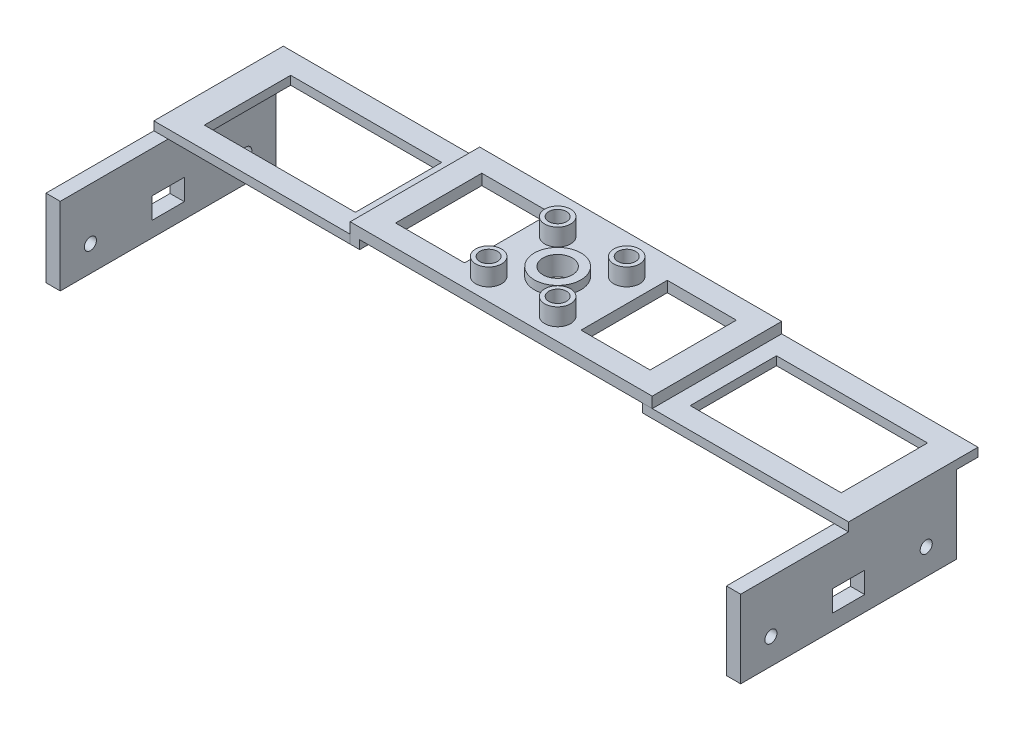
ISO-10303-21;
HEADER;
FILE_DESCRIPTION(('STEP AP214'),'2;1');
FILE_NAME('part.step','',(''),(''),'','','');
FILE_SCHEMA(('AUTOMOTIVE_DESIGN { 1 0 10303 214 1 1 1 1 }'));
ENDSEC;
DATA;
#1=APPLICATION_CONTEXT('core data for automotive mechanical design processes');
#2=APPLICATION_PROTOCOL_DEFINITION('international standard','automotive_design',2000,#1);
#3=PRODUCT_CONTEXT('',#1,'mechanical');
#4=PRODUCT('Part','Part','',(#3));
#5=PRODUCT_RELATED_PRODUCT_CATEGORY('part','',(#4));
#6=PRODUCT_DEFINITION_FORMATION('','',#4);
#7=PRODUCT_DEFINITION_CONTEXT('part definition',#1,'design');
#8=PRODUCT_DEFINITION('design','',#6,#7);
#9=PRODUCT_DEFINITION_SHAPE('','',#8);
#10=(LENGTH_UNIT() NAMED_UNIT(*) SI_UNIT(.MILLI.,.METRE.));
#11=(NAMED_UNIT(*) PLANE_ANGLE_UNIT() SI_UNIT($,.RADIAN.));
#12=(NAMED_UNIT(*) SI_UNIT($,.STERADIAN.) SOLID_ANGLE_UNIT());
#13=UNCERTAINTY_MEASURE_WITH_UNIT(LENGTH_MEASURE(1.E-05),#10,'distance_accuracy_value','');
#14=(GEOMETRIC_REPRESENTATION_CONTEXT(3) GLOBAL_UNCERTAINTY_ASSIGNED_CONTEXT((#13)) GLOBAL_UNIT_ASSIGNED_CONTEXT((#10,
#11,#12)) REPRESENTATION_CONTEXT('',''));
#15=CARTESIAN_POINT('',(0.,0.,0.));
#16=DIRECTION('',(0.,0.,1.));
#17=DIRECTION('',(1.,0.,0.));
#18=AXIS2_PLACEMENT_3D('',#15,#16,#17);
#19=CARTESIAN_POINT('',(35.,-0.5,-16.9191374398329));
#20=DIRECTION('',(1.,0.,0.));
#21=DIRECTION('',(0.,0.,-1.));
#22=AXIS2_PLACEMENT_3D('',#19,#20,#21);
#23=PLANE('',#22);
#24=DIRECTION('',(0.,-1.,0.));
#25=VECTOR('',#24,1.);
#26=CARTESIAN_POINT('',(35.,-0.5,13.0808625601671));
#27=LINE('',#26,#25);
#28=CARTESIAN_POINT('',(35.,-5.5,13.0808625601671));
#29=VERTEX_POINT('',#28);
#30=CARTESIAN_POINT('',(35.,-10.,13.0808625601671));
#31=VERTEX_POINT('',#30);
#32=EDGE_CURVE('E292',#29,#31,#27,.T.);
#33=ORIENTED_EDGE('',*,*,#32,.T.);
#34=DIRECTION('',(0.,0.,1.));
#35=VECTOR('',#34,1.);
#36=CARTESIAN_POINT('',(35.,-10.,13.0808625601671));
#37=LINE('',#36,#35);
#38=CARTESIAN_POINT('',(35.,-10.,-16.9191374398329));
#39=VERTEX_POINT('',#38);
#40=EDGE_CURVE('E248',#39,#31,#37,.T.);
#41=ORIENTED_EDGE('',*,*,#40,.F.);
#42=DIRECTION('',(0.,-1.,0.));
#43=VECTOR('',#42,1.);
#44=CARTESIAN_POINT('',(35.,-0.5,-16.9191374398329));
#45=LINE('',#44,#43);
#46=CARTESIAN_POINT('',(35.,-5.5,-16.9191374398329));
#47=VERTEX_POINT('',#46);
#48=EDGE_CURVE('E289',#47,#39,#45,.T.);
#49=ORIENTED_EDGE('',*,*,#48,.F.);
#50=DIRECTION('',(0.,0.,-1.));
#51=VECTOR('',#50,1.);
#52=CARTESIAN_POINT('',(35.,-5.5,0.));
#53=LINE('',#52,#51);
#54=EDGE_CURVE('E308',#29,#47,#53,.T.);
#55=ORIENTED_EDGE('',*,*,#54,.F.);
#56=EDGE_LOOP('',(#33,#41,#49,#55));
#57=FACE_BOUND('',#56,.T.);
#58=ADVANCED_FACE('F51',(#57),#23,.T.);
#59=CARTESIAN_POINT('',(32.8,-18.,13.0808625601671));
#60=DIRECTION('',(1.,0.,0.));
#61=DIRECTION('',(0.,0.,-1.));
#62=AXIS2_PLACEMENT_3D('',#59,#60,#61);
#63=PLANE('',#62);
#64=DIRECTION('',(0.,0.,-1.));
#65=VECTOR('',#64,1.);
#66=CARTESIAN_POINT('',(32.8,-10.,13.0808625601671));
#67=LINE('',#66,#65);
#68=CARTESIAN_POINT('',(32.8,-10.,13.0808625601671));
#69=VERTEX_POINT('',#68);
#70=CARTESIAN_POINT('',(32.8,-10.,-16.9191374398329));
#71=VERTEX_POINT('',#70);
#72=EDGE_CURVE('E240',#69,#71,#67,.T.);
#73=ORIENTED_EDGE('',*,*,#72,.F.);
#74=DIRECTION('',(0.,1.,0.));
#75=VECTOR('',#74,1.);
#76=CARTESIAN_POINT('',(32.8,-18.,13.0808625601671));
#77=LINE('',#76,#75);
#78=CARTESIAN_POINT('',(32.8,-8.,13.0808625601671));
#79=VERTEX_POINT('',#78);
#80=EDGE_CURVE('E311',#69,#79,#77,.T.);
#81=ORIENTED_EDGE('',*,*,#80,.T.);
#82=DIRECTION('',(0.,0.,-1.));
#83=VECTOR('',#82,1.);
#84=CARTESIAN_POINT('',(32.8,-8.,13.0808625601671));
#85=LINE('',#84,#83);
#86=CARTESIAN_POINT('',(32.8,-8.,-16.9191374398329));
#87=VERTEX_POINT('',#86);
#88=EDGE_CURVE('E304',#79,#87,#85,.T.);
#89=ORIENTED_EDGE('',*,*,#88,.T.);
#90=DIRECTION('',(0.,1.,0.));
#91=VECTOR('',#90,1.);
#92=CARTESIAN_POINT('',(32.8,-18.,-16.9191374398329));
#93=LINE('',#92,#91);
#94=EDGE_CURVE('E55',#71,#87,#93,.T.);
#95=ORIENTED_EDGE('',*,*,#94,.F.);
#96=EDGE_LOOP('',(#73,#81,#89,#95));
#97=FACE_BOUND('',#96,.T.);
#98=ADVANCED_FACE('F358',(#97),#63,.F.);
#99=CARTESIAN_POINT('',(-35.,-0.5,-16.9191374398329));
#100=DIRECTION('',(0.,0.,-1.));
#101=DIRECTION('',(-1.,0.,0.));
#102=AXIS2_PLACEMENT_3D('',#99,#100,#101);
#103=PLANE('',#102);
#104=DIRECTION('',(0.,1.,0.));
#105=VECTOR('',#104,1.);
#106=CARTESIAN_POINT('',(-32.8,-18.,-16.9191374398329));
#107=LINE('',#106,#105);
#108=CARTESIAN_POINT('',(-32.8,-10.,-16.9191374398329));
#109=VERTEX_POINT('',#108);
#110=CARTESIAN_POINT('',(-32.8,-8.,-16.9191374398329));
#111=VERTEX_POINT('',#110);
#112=EDGE_CURVE('E283',#109,#111,#107,.T.);
#113=ORIENTED_EDGE('',*,*,#112,.F.);
#114=DIRECTION('',(1.,0.,0.));
#115=VECTOR('',#114,1.);
#116=CARTESIAN_POINT('',(-35.,-10.,-16.9191374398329));
#117=LINE('',#116,#115);
#118=CARTESIAN_POINT('',(-35.,-10.,-16.9191374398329));
#119=VERTEX_POINT('',#118);
#120=EDGE_CURVE('E239',#119,#109,#117,.T.);
#121=ORIENTED_EDGE('',*,*,#120,.F.);
#122=DIRECTION('',(0.,-1.,0.));
#123=VECTOR('',#122,1.);
#124=CARTESIAN_POINT('',(-35.,-0.5,-16.9191374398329));
#125=LINE('',#124,#123);
#126=CARTESIAN_POINT('',(-35.,-5.5,-16.9191374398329));
#127=VERTEX_POINT('',#126);
#128=EDGE_CURVE('E285',#127,#119,#125,.T.);
#129=ORIENTED_EDGE('',*,*,#128,.F.);
#130=DIRECTION('',(-1.,0.,0.));
#131=VECTOR('',#130,1.);
#132=CARTESIAN_POINT('',(0.,-5.5,-16.9191374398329));
#133=LINE('',#132,#131);
#134=EDGE_CURVE('E315',#47,#127,#133,.T.);
#135=ORIENTED_EDGE('',*,*,#134,.F.);
#136=ORIENTED_EDGE('',*,*,#48,.T.);
#137=DIRECTION('',(1.,0.,0.));
#138=VECTOR('',#137,1.);
#139=CARTESIAN_POINT('',(32.8,-10.,-16.9191374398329));
#140=LINE('',#139,#138);
#141=EDGE_CURVE('E250',#71,#39,#140,.T.);
#142=ORIENTED_EDGE('',*,*,#141,.F.);
#143=ORIENTED_EDGE('',*,*,#94,.T.);
#144=DIRECTION('',(1.,0.,0.));
#145=VECTOR('',#144,1.);
#146=CARTESIAN_POINT('',(-35.,-8.,-16.9191374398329));
#147=LINE('',#146,#145);
#148=EDGE_CURVE('E284',#111,#87,#147,.T.);
#149=ORIENTED_EDGE('',*,*,#148,.F.);
#150=EDGE_LOOP('',(#113,#121,#129,#135,#136,#142,#143,#149));
#151=FACE_BOUND('',#150,.T.);
#152=ADVANCED_FACE('F353',(#151),#103,.T.);
#153=CARTESIAN_POINT('',(-35.,-0.5,13.0808625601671));
#154=DIRECTION('',(0.,0.,-1.));
#155=DIRECTION('',(-1.,0.,0.));
#156=AXIS2_PLACEMENT_3D('',#153,#154,#155);
#157=PLANE('',#156);
#158=DIRECTION('',(-1.,0.,0.));
#159=VECTOR('',#158,1.);
#160=CARTESIAN_POINT('',(-35.,-10.,13.0808625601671));
#161=LINE('',#160,#159);
#162=CARTESIAN_POINT('',(-32.8,-10.,13.0808625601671));
#163=VERTEX_POINT('',#162);
#164=CARTESIAN_POINT('',(-35.,-10.,13.0808625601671));
#165=VERTEX_POINT('',#164);
#166=EDGE_CURVE('E244',#163,#165,#161,.T.);
#167=ORIENTED_EDGE('',*,*,#166,.F.);
#168=DIRECTION('',(0.,1.,0.));
#169=VECTOR('',#168,1.);
#170=CARTESIAN_POINT('',(-32.8,-18.,13.0808625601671));
#171=LINE('',#170,#169);
#172=CARTESIAN_POINT('',(-32.8,-8.,13.0808625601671));
#173=VERTEX_POINT('',#172);
#174=EDGE_CURVE('E305',#163,#173,#171,.T.);
#175=ORIENTED_EDGE('',*,*,#174,.T.);
#176=DIRECTION('',(1.,0.,0.));
#177=VECTOR('',#176,1.);
#178=CARTESIAN_POINT('',(20.,-8.,13.0808625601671));
#179=LINE('',#178,#177);
#180=EDGE_CURVE('E288',#173,#79,#179,.T.);
#181=ORIENTED_EDGE('',*,*,#180,.T.);
#182=ORIENTED_EDGE('',*,*,#80,.F.);
#183=DIRECTION('',(-1.,0.,0.));
#184=VECTOR('',#183,1.);
#185=CARTESIAN_POINT('',(32.8,-10.,13.0808625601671));
#186=LINE('',#185,#184);
#187=EDGE_CURVE('E236',#31,#69,#186,.T.);
#188=ORIENTED_EDGE('',*,*,#187,.F.);
#189=ORIENTED_EDGE('',*,*,#32,.F.);
#190=DIRECTION('',(1.,0.,0.));
#191=VECTOR('',#190,1.);
#192=CARTESIAN_POINT('',(0.,-5.5,13.0808625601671));
#193=LINE('',#192,#191);
#194=CARTESIAN_POINT('',(-35.,-5.5,13.0808625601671));
#195=VERTEX_POINT('',#194);
#196=EDGE_CURVE('E310',#195,#29,#193,.T.);
#197=ORIENTED_EDGE('',*,*,#196,.F.);
#198=DIRECTION('',(0.,-1.,0.));
#199=VECTOR('',#198,1.);
#200=CARTESIAN_POINT('',(-35.,-0.5,13.0808625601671));
#201=LINE('',#200,#199);
#202=EDGE_CURVE('E267',#195,#165,#201,.T.);
#203=ORIENTED_EDGE('',*,*,#202,.T.);
#204=EDGE_LOOP('',(#167,#175,#181,#182,#188,#189,#197,#203));
#205=FACE_BOUND('',#204,.T.);
#206=ADVANCED_FACE('F53',(#205),#157,.F.);
#207=CARTESIAN_POINT('',(-32.8,-18.,13.0808625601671));
#208=DIRECTION('',(-1.,0.,0.));
#209=DIRECTION('',(0.,0.,1.));
#210=AXIS2_PLACEMENT_3D('',#207,#208,#209);
#211=PLANE('',#210);
#212=DIRECTION('',(0.,0.,1.));
#213=VECTOR('',#212,1.);
#214=CARTESIAN_POINT('',(-32.8,-10.,13.0808625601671));
#215=LINE('',#214,#213);
#216=EDGE_CURVE('E242',#109,#163,#215,.T.);
#217=ORIENTED_EDGE('',*,*,#216,.F.);
#218=ORIENTED_EDGE('',*,*,#112,.T.);
#219=DIRECTION('',(0.,0.,1.));
#220=VECTOR('',#219,1.);
#221=CARTESIAN_POINT('',(-32.8,-8.,13.0808625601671));
#222=LINE('',#221,#220);
#223=EDGE_CURVE('E301',#111,#173,#222,.T.);
#224=ORIENTED_EDGE('',*,*,#223,.T.);
#225=ORIENTED_EDGE('',*,*,#174,.F.);
#226=EDGE_LOOP('',(#217,#218,#224,#225));
#227=FACE_BOUND('',#226,.T.);
#228=ADVANCED_FACE('F412',(#227),#211,.F.);
#229=CARTESIAN_POINT('',(-35.,-0.5,13.0808625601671));
#230=DIRECTION('',(-1.,0.,0.));
#231=DIRECTION('',(0.,0.,1.));
#232=AXIS2_PLACEMENT_3D('',#229,#230,#231);
#233=PLANE('',#232);
#234=ORIENTED_EDGE('',*,*,#128,.T.);
#235=DIRECTION('',(0.,0.,-1.));
#236=VECTOR('',#235,1.);
#237=CARTESIAN_POINT('',(-35.,-10.,13.0808625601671));
#238=LINE('',#237,#236);
#239=EDGE_CURVE('E237',#165,#119,#238,.T.);
#240=ORIENTED_EDGE('',*,*,#239,.F.);
#241=ORIENTED_EDGE('',*,*,#202,.F.);
#242=DIRECTION('',(0.,0.,1.));
#243=VECTOR('',#242,1.);
#244=CARTESIAN_POINT('',(-35.,-5.5,0.));
#245=LINE('',#244,#243);
#246=EDGE_CURVE('E313',#127,#195,#245,.T.);
#247=ORIENTED_EDGE('',*,*,#246,.F.);
#248=EDGE_LOOP('',(#234,#240,#241,#247));
#249=FACE_BOUND('',#248,.T.);
#250=ADVANCED_FACE('F414',(#249),#233,.T.);
#251=CARTESIAN_POINT('',(0.,-9.5,0.));
#252=DIRECTION('',(0.,1.,0.));
#253=DIRECTION('',(0.,0.,1.));
#254=AXIS2_PLACEMENT_3D('',#251,#252,#253);
#255=CYLINDRICAL_SURFACE('',#254,3.4);
#256=CARTESIAN_POINT('',(0.,-8.,0.));
#257=DIRECTION('',(0.,1.,0.));
#258=DIRECTION('',(0.,0.,1.));
#259=AXIS2_PLACEMENT_3D('',#256,#257,#258);
#260=CIRCLE('',#259,3.4);
#261=CARTESIAN_POINT('',(0.,-8.,3.4));
#262=VERTEX_POINT('',#261);
#263=EDGE_CURVE('E280',#262,#262,#260,.T.);
#264=ORIENTED_EDGE('',*,*,#263,.F.);
#265=EDGE_LOOP('',(#264));
#266=FACE_BOUND('',#265,.T.);
#267=CARTESIAN_POINT('',(0.,-3.5,0.));
#268=DIRECTION('',(0.,1.,0.));
#269=DIRECTION('',(0.,0.,1.));
#270=AXIS2_PLACEMENT_3D('',#267,#268,#269);
#271=CIRCLE('',#270,3.4);
#272=CARTESIAN_POINT('',(0.,-3.5,3.4));
#273=VERTEX_POINT('',#272);
#274=EDGE_CURVE('E246',#273,#273,#271,.T.);
#275=ORIENTED_EDGE('',*,*,#274,.T.);
#276=EDGE_LOOP('',(#275));
#277=FACE_BOUND('',#276,.T.);
#278=ADVANCED_FACE('F374',(#266,#277),#255,.F.);
#279=CARTESIAN_POINT('',(8.,-5.5,-8.));
#280=DIRECTION('',(0.,1.,0.));
#281=DIRECTION('',(0.,0.,1.));
#282=AXIS2_PLACEMENT_3D('',#279,#280,#281);
#283=CYLINDRICAL_SURFACE('',#282,2.05);
#284=CARTESIAN_POINT('',(8.,-1.5,-8.));
#285=DIRECTION('',(0.,1.,0.));
#286=DIRECTION('',(0.,0.,1.));
#287=AXIS2_PLACEMENT_3D('',#284,#285,#286);
#288=CIRCLE('',#287,2.05);
#289=CARTESIAN_POINT('',(8.,-1.5,-5.95));
#290=VERTEX_POINT('',#289);
#291=EDGE_CURVE('E268',#290,#290,#288,.T.);
#292=ORIENTED_EDGE('',*,*,#291,.T.);
#293=EDGE_LOOP('',(#292));
#294=FACE_BOUND('',#293,.T.);
#295=CARTESIAN_POINT('',(8.,-7.5,-8.));
#296=DIRECTION('',(0.,1.,0.));
#297=DIRECTION('',(0.,0.,1.));
#298=AXIS2_PLACEMENT_3D('',#295,#296,#297);
#299=CIRCLE('',#298,2.05);
#300=CARTESIAN_POINT('',(8.,-7.5,-5.95));
#301=VERTEX_POINT('',#300);
#302=EDGE_CURVE('E260',#301,#301,#299,.T.);
#303=ORIENTED_EDGE('',*,*,#302,.F.);
#304=EDGE_LOOP('',(#303));
#305=FACE_BOUND('',#304,.T.);
#306=ADVANCED_FACE('F401',(#294,#305),#283,.F.);
#307=CARTESIAN_POINT('',(8.,-5.5,8.));
#308=DIRECTION('',(0.,1.,0.));
#309=DIRECTION('',(0.,0.,1.));
#310=AXIS2_PLACEMENT_3D('',#307,#308,#309);
#311=CYLINDRICAL_SURFACE('',#310,2.05);
#312=CARTESIAN_POINT('',(8.,-1.5,8.));
#313=DIRECTION('',(0.,1.,0.));
#314=DIRECTION('',(0.,0.,1.));
#315=AXIS2_PLACEMENT_3D('',#312,#313,#314);
#316=CIRCLE('',#315,2.05);
#317=CARTESIAN_POINT('',(8.,-1.5,10.05));
#318=VERTEX_POINT('',#317);
#319=EDGE_CURVE('E275',#318,#318,#316,.T.);
#320=ORIENTED_EDGE('',*,*,#319,.T.);
#321=EDGE_LOOP('',(#320));
#322=FACE_BOUND('',#321,.T.);
#323=CARTESIAN_POINT('',(8.,-7.5,8.));
#324=DIRECTION('',(0.,1.,0.));
#325=DIRECTION('',(0.,0.,1.));
#326=AXIS2_PLACEMENT_3D('',#323,#324,#325);
#327=CIRCLE('',#326,2.05);
#328=CARTESIAN_POINT('',(8.,-7.5,10.05));
#329=VERTEX_POINT('',#328);
#330=EDGE_CURVE('E256',#329,#329,#327,.T.);
#331=ORIENTED_EDGE('',*,*,#330,.F.);
#332=EDGE_LOOP('',(#331));
#333=FACE_BOUND('',#332,.T.);
#334=ADVANCED_FACE('F397',(#322,#333),#311,.F.);
#335=CARTESIAN_POINT('',(-8.,-5.5,8.));
#336=DIRECTION('',(0.,1.,0.));
#337=DIRECTION('',(0.,0.,1.));
#338=AXIS2_PLACEMENT_3D('',#335,#336,#337);
#339=CYLINDRICAL_SURFACE('',#338,2.05);
#340=CARTESIAN_POINT('',(-8.,-1.5,8.));
#341=DIRECTION('',(0.,1.,0.));
#342=DIRECTION('',(0.,0.,1.));
#343=AXIS2_PLACEMENT_3D('',#340,#341,#342);
#344=CIRCLE('',#343,2.05);
#345=CARTESIAN_POINT('',(-8.,-1.5,10.05));
#346=VERTEX_POINT('',#345);
#347=EDGE_CURVE('E271',#346,#346,#344,.T.);
#348=ORIENTED_EDGE('',*,*,#347,.T.);
#349=EDGE_LOOP('',(#348));
#350=FACE_BOUND('',#349,.T.);
#351=CARTESIAN_POINT('',(-8.,-7.5,8.));
#352=DIRECTION('',(0.,1.,0.));
#353=DIRECTION('',(0.,0.,1.));
#354=AXIS2_PLACEMENT_3D('',#351,#352,#353);
#355=CIRCLE('',#354,2.05);
#356=CARTESIAN_POINT('',(-8.,-7.5,10.05));
#357=VERTEX_POINT('',#356);
#358=EDGE_CURVE('E259',#357,#357,#355,.T.);
#359=ORIENTED_EDGE('',*,*,#358,.F.);
#360=EDGE_LOOP('',(#359));
#361=FACE_BOUND('',#360,.T.);
#362=ADVANCED_FACE('F394',(#350,#361),#339,.F.);
#363=CARTESIAN_POINT('',(-8.,-5.5,-8.));
#364=DIRECTION('',(0.,1.,0.));
#365=DIRECTION('',(0.,0.,1.));
#366=AXIS2_PLACEMENT_3D('',#363,#364,#365);
#367=CYLINDRICAL_SURFACE('',#366,2.05);
#368=CARTESIAN_POINT('',(-8.,-1.5,-8.));
#369=DIRECTION('',(0.,1.,0.));
#370=DIRECTION('',(0.,0.,1.));
#371=AXIS2_PLACEMENT_3D('',#368,#369,#370);
#372=CIRCLE('',#371,2.05);
#373=CARTESIAN_POINT('',(-8.,-1.5,-5.95));
#374=VERTEX_POINT('',#373);
#375=EDGE_CURVE('E60',#374,#374,#372,.T.);
#376=ORIENTED_EDGE('',*,*,#375,.T.);
#377=EDGE_LOOP('',(#376));
#378=FACE_BOUND('',#377,.T.);
#379=CARTESIAN_POINT('',(-8.,-7.5,-8.));
#380=DIRECTION('',(0.,1.,0.));
#381=DIRECTION('',(0.,0.,1.));
#382=AXIS2_PLACEMENT_3D('',#379,#380,#381);
#383=CIRCLE('',#382,2.05);
#384=CARTESIAN_POINT('',(-8.,-7.5,-5.95));
#385=VERTEX_POINT('',#384);
#386=EDGE_CURVE('E255',#385,#385,#383,.T.);
#387=ORIENTED_EDGE('',*,*,#386,.F.);
#388=EDGE_LOOP('',(#387));
#389=FACE_BOUND('',#388,.T.);
#390=ADVANCED_FACE('F389',(#378,#389),#367,.F.);
#391=CARTESIAN_POINT('',(8.,-1.5,-8.));
#392=DIRECTION('',(0.,1.,0.));
#393=DIRECTION('',(0.,0.,1.));
#394=AXIS2_PLACEMENT_3D('',#391,#392,#393);
#395=PLANE('',#394);
#396=ORIENTED_EDGE('',*,*,#291,.F.);
#397=EDGE_LOOP('',(#396));
#398=FACE_BOUND('',#397,.T.);
#399=CARTESIAN_POINT('',(8.,-1.5,-8.));
#400=DIRECTION('',(0.,1.,0.));
#401=DIRECTION('',(0.,0.,1.));
#402=AXIS2_PLACEMENT_3D('',#399,#400,#401);
#403=CIRCLE('',#402,3.);
#404=CARTESIAN_POINT('',(8.,-1.5,-5.));
#405=VERTEX_POINT('',#404);
#406=EDGE_CURVE('E335',#405,#405,#403,.T.);
#407=ORIENTED_EDGE('',*,*,#406,.T.);
#408=EDGE_LOOP('',(#407));
#409=FACE_BOUND('',#408,.T.);
#410=ADVANCED_FACE('F385',(#398,#409),#395,.T.);
#411=CARTESIAN_POINT('',(8.,-1.5,8.));
#412=DIRECTION('',(0.,1.,0.));
#413=DIRECTION('',(0.,0.,1.));
#414=AXIS2_PLACEMENT_3D('',#411,#412,#413);
#415=PLANE('',#414);
#416=ORIENTED_EDGE('',*,*,#319,.F.);
#417=EDGE_LOOP('',(#416));
#418=FACE_BOUND('',#417,.T.);
#419=CARTESIAN_POINT('',(8.,-1.5,8.));
#420=DIRECTION('',(0.,1.,0.));
#421=DIRECTION('',(0.,0.,1.));
#422=AXIS2_PLACEMENT_3D('',#419,#420,#421);
#423=CIRCLE('',#422,3.);
#424=CARTESIAN_POINT('',(8.,-1.5,11.));
#425=VERTEX_POINT('',#424);
#426=EDGE_CURVE('E272',#425,#425,#423,.T.);
#427=ORIENTED_EDGE('',*,*,#426,.T.);
#428=EDGE_LOOP('',(#427));
#429=FACE_BOUND('',#428,.T.);
#430=ADVANCED_FACE('F388',(#418,#429),#415,.T.);
#431=CARTESIAN_POINT('',(0.,-3.5,0.));
#432=DIRECTION('',(0.,1.,0.));
#433=DIRECTION('',(0.,0.,1.));
#434=AXIS2_PLACEMENT_3D('',#431,#432,#433);
#435=PLANE('',#434);
#436=CARTESIAN_POINT('',(0.,-3.5,0.));
#437=DIRECTION('',(0.,1.,0.));
#438=DIRECTION('',(0.,0.,1.));
#439=AXIS2_PLACEMENT_3D('',#436,#437,#438);
#440=CIRCLE('',#439,5.4);
#441=CARTESIAN_POINT('',(0.,-3.5,5.4));
#442=VERTEX_POINT('',#441);
#443=EDGE_CURVE('E13',#442,#442,#440,.T.);
#444=ORIENTED_EDGE('',*,*,#443,.T.);
#445=EDGE_LOOP('',(#444));
#446=FACE_BOUND('',#445,.T.);
#447=ORIENTED_EDGE('',*,*,#274,.F.);
#448=EDGE_LOOP('',(#447));
#449=FACE_BOUND('',#448,.T.);
#450=ADVANCED_FACE('F383',(#446,#449),#435,.T.);
#451=CARTESIAN_POINT('',(-8.,-1.5,8.));
#452=DIRECTION('',(0.,1.,0.));
#453=DIRECTION('',(0.,0.,1.));
#454=AXIS2_PLACEMENT_3D('',#451,#452,#453);
#455=PLANE('',#454);
#456=ORIENTED_EDGE('',*,*,#347,.F.);
#457=EDGE_LOOP('',(#456));
#458=FACE_BOUND('',#457,.T.);
#459=CARTESIAN_POINT('',(-8.,-1.5,8.));
#460=DIRECTION('',(0.,1.,0.));
#461=DIRECTION('',(0.,0.,1.));
#462=AXIS2_PLACEMENT_3D('',#459,#460,#461);
#463=CIRCLE('',#462,3.);
#464=CARTESIAN_POINT('',(-8.,-1.5,11.));
#465=VERTEX_POINT('',#464);
#466=EDGE_CURVE('E336',#465,#465,#463,.T.);
#467=ORIENTED_EDGE('',*,*,#466,.T.);
#468=EDGE_LOOP('',(#467));
#469=FACE_BOUND('',#468,.T.);
#470=ADVANCED_FACE('F379',(#458,#469),#455,.T.);
#471=CARTESIAN_POINT('',(-8.,-1.5,-8.));
#472=DIRECTION('',(0.,1.,0.));
#473=DIRECTION('',(0.,0.,1.));
#474=AXIS2_PLACEMENT_3D('',#471,#472,#473);
#475=PLANE('',#474);
#476=ORIENTED_EDGE('',*,*,#375,.F.);
#477=EDGE_LOOP('',(#476));
#478=FACE_BOUND('',#477,.T.);
#479=CARTESIAN_POINT('',(-8.,-1.5,-8.));
#480=DIRECTION('',(0.,1.,0.));
#481=DIRECTION('',(0.,0.,1.));
#482=AXIS2_PLACEMENT_3D('',#479,#480,#481);
#483=CIRCLE('',#482,3.);
#484=CARTESIAN_POINT('',(-8.,-1.5,-5.));
#485=VERTEX_POINT('',#484);
#486=EDGE_CURVE('E332',#485,#485,#483,.T.);
#487=ORIENTED_EDGE('',*,*,#486,.T.);
#488=EDGE_LOOP('',(#487));
#489=FACE_BOUND('',#488,.T.);
#490=ADVANCED_FACE('F375',(#478,#489),#475,.T.);
#491=CARTESIAN_POINT('',(8.,3.5,-8.));
#492=DIRECTION('',(0.,-1.,0.));
#493=DIRECTION('',(0.,0.,-1.));
#494=AXIS2_PLACEMENT_3D('',#491,#492,#493);
#495=CYLINDRICAL_SURFACE('',#494,3.);
#496=CARTESIAN_POINT('',(8.,-5.5,-8.));
#497=DIRECTION('',(0.,1.,0.));
#498=DIRECTION('',(0.,0.,1.));
#499=AXIS2_PLACEMENT_3D('',#496,#497,#498);
#500=CIRCLE('',#499,3.);
#501=CARTESIAN_POINT('',(8.,-5.5,-5.));
#502=VERTEX_POINT('',#501);
#503=EDGE_CURVE('E317',#502,#502,#500,.F.);
#504=ORIENTED_EDGE('',*,*,#503,.F.);
#505=EDGE_LOOP('',(#504));
#506=FACE_BOUND('',#505,.T.);
#507=ORIENTED_EDGE('',*,*,#406,.F.);
#508=EDGE_LOOP('',(#507));
#509=FACE_BOUND('',#508,.T.);
#510=ADVANCED_FACE('F378',(#506,#509),#495,.T.);
#511=CARTESIAN_POINT('',(8.,3.5,8.));
#512=DIRECTION('',(0.,-1.,0.));
#513=DIRECTION('',(0.,0.,-1.));
#514=AXIS2_PLACEMENT_3D('',#511,#512,#513);
#515=CYLINDRICAL_SURFACE('',#514,3.);
#516=CARTESIAN_POINT('',(8.,-5.5,8.));
#517=DIRECTION('',(0.,1.,0.));
#518=DIRECTION('',(0.,0.,1.));
#519=AXIS2_PLACEMENT_3D('',#516,#517,#518);
#520=CIRCLE('',#519,3.);
#521=CARTESIAN_POINT('',(8.,-5.5,11.));
#522=VERTEX_POINT('',#521);
#523=EDGE_CURVE('E320',#522,#522,#520,.F.);
#524=ORIENTED_EDGE('',*,*,#523,.F.);
#525=EDGE_LOOP('',(#524));
#526=FACE_BOUND('',#525,.T.);
#527=ORIENTED_EDGE('',*,*,#426,.F.);
#528=EDGE_LOOP('',(#527));
#529=FACE_BOUND('',#528,.T.);
#530=ADVANCED_FACE('F484',(#526,#529),#515,.T.);
#531=CARTESIAN_POINT('',(0.,0.5,0.));
#532=DIRECTION('',(0.,-1.,0.));
#533=DIRECTION('',(0.,0.,-1.));
#534=AXIS2_PLACEMENT_3D('',#531,#532,#533);
#535=CYLINDRICAL_SURFACE('',#534,5.4);
#536=CARTESIAN_POINT('',(0.,-5.5,0.));
#537=DIRECTION('',(0.,1.,0.));
#538=DIRECTION('',(0.,0.,1.));
#539=AXIS2_PLACEMENT_3D('',#536,#537,#538);
#540=CIRCLE('',#539,5.4);
#541=CARTESIAN_POINT('',(0.,-5.5,5.4));
#542=VERTEX_POINT('',#541);
#543=EDGE_CURVE('E323',#542,#542,#540,.F.);
#544=ORIENTED_EDGE('',*,*,#543,.F.);
#545=EDGE_LOOP('',(#544));
#546=FACE_BOUND('',#545,.T.);
#547=ORIENTED_EDGE('',*,*,#443,.F.);
#548=EDGE_LOOP('',(#547));
#549=FACE_BOUND('',#548,.T.);
#550=ADVANCED_FACE('F369',(#546,#549),#535,.T.);
#551=CARTESIAN_POINT('',(-8.,3.5,8.));
#552=DIRECTION('',(0.,-1.,0.));
#553=DIRECTION('',(0.,0.,-1.));
#554=AXIS2_PLACEMENT_3D('',#551,#552,#553);
#555=CYLINDRICAL_SURFACE('',#554,3.);
#556=CARTESIAN_POINT('',(-8.,-5.5,8.));
#557=DIRECTION('',(0.,1.,0.));
#558=DIRECTION('',(0.,0.,1.));
#559=AXIS2_PLACEMENT_3D('',#556,#557,#558);
#560=CIRCLE('',#559,3.);
#561=CARTESIAN_POINT('',(-8.,-5.5,11.));
#562=VERTEX_POINT('',#561);
#563=EDGE_CURVE('E326',#562,#562,#560,.F.);
#564=ORIENTED_EDGE('',*,*,#563,.F.);
#565=EDGE_LOOP('',(#564));
#566=FACE_BOUND('',#565,.T.);
#567=ORIENTED_EDGE('',*,*,#466,.F.);
#568=EDGE_LOOP('',(#567));
#569=FACE_BOUND('',#568,.T.);
#570=ADVANCED_FACE('F480',(#566,#569),#555,.T.);
#571=CARTESIAN_POINT('',(-8.,3.5,-8.));
#572=DIRECTION('',(0.,-1.,0.));
#573=DIRECTION('',(0.,0.,-1.));
#574=AXIS2_PLACEMENT_3D('',#571,#572,#573);
#575=CYLINDRICAL_SURFACE('',#574,3.);
#576=CARTESIAN_POINT('',(-8.,-5.5,-8.));
#577=DIRECTION('',(0.,1.,0.));
#578=DIRECTION('',(0.,0.,1.));
#579=AXIS2_PLACEMENT_3D('',#576,#577,#578);
#580=CIRCLE('',#579,3.);
#581=CARTESIAN_POINT('',(-8.,-5.5,-5.));
#582=VERTEX_POINT('',#581);
#583=EDGE_CURVE('E329',#582,#582,#580,.F.);
#584=ORIENTED_EDGE('',*,*,#583,.F.);
#585=EDGE_LOOP('',(#584));
#586=FACE_BOUND('',#585,.T.);
#587=ORIENTED_EDGE('',*,*,#486,.F.);
#588=EDGE_LOOP('',(#587));
#589=FACE_BOUND('',#588,.T.);
#590=ADVANCED_FACE('F473',(#586,#589),#575,.T.);
#591=CARTESIAN_POINT('',(0.,-8.,0.));
#592=DIRECTION('',(0.,1.,0.));
#593=DIRECTION('',(0.,0.,1.));
#594=AXIS2_PLACEMENT_3D('',#591,#592,#593);
#595=PLANE('',#594);
#596=DIRECTION('',(-1.,0.,0.));
#597=VECTOR('',#596,1.);
#598=CARTESIAN_POINT('',(0.,-8.,-11.9191374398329));
#599=LINE('',#598,#597);
#600=CARTESIAN_POINT('',(-13.5,-8.,-11.9191374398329));
#601=VERTEX_POINT('',#600);
#602=CARTESIAN_POINT('',(-29.5,-8.,-11.9191374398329));
#603=VERTEX_POINT('',#602);
#604=EDGE_CURVE('E230',#601,#603,#599,.T.);
#605=ORIENTED_EDGE('',*,*,#604,.T.);
#606=DIRECTION('',(0.,0.,1.));
#607=VECTOR('',#606,1.);
#608=CARTESIAN_POINT('',(-29.5,-8.,0.));
#609=LINE('',#608,#607);
#610=CARTESIAN_POINT('',(-29.5,-8.,8.08086256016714));
#611=VERTEX_POINT('',#610);
#612=EDGE_CURVE('E233',#603,#611,#609,.T.);
#613=ORIENTED_EDGE('',*,*,#612,.T.);
#614=DIRECTION('',(1.,0.,0.));
#615=VECTOR('',#614,1.);
#616=CARTESIAN_POINT('',(0.,-8.,8.08086256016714));
#617=LINE('',#616,#615);
#618=CARTESIAN_POINT('',(-13.5,-8.,8.08086256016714));
#619=VERTEX_POINT('',#618);
#620=EDGE_CURVE('E227',#611,#619,#617,.T.);
#621=ORIENTED_EDGE('',*,*,#620,.T.);
#622=DIRECTION('',(0.,0.,-1.));
#623=VECTOR('',#622,1.);
#624=CARTESIAN_POINT('',(-13.5,-8.,0.));
#625=LINE('',#624,#623);
#626=EDGE_CURVE('E171',#619,#601,#625,.T.);
#627=ORIENTED_EDGE('',*,*,#626,.T.);
#628=EDGE_LOOP('',(#605,#613,#621,#627));
#629=FACE_BOUND('',#628,.T.);
#630=DIRECTION('',(-1.,0.,0.));
#631=VECTOR('',#630,1.);
#632=CARTESIAN_POINT('',(0.,-8.,-11.9191374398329));
#633=LINE('',#632,#631);
#634=CARTESIAN_POINT('',(29.5,-8.,-11.9191374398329));
#635=VERTEX_POINT('',#634);
#636=CARTESIAN_POINT('',(13.5,-8.,-11.9191374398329));
#637=VERTEX_POINT('',#636);
#638=EDGE_CURVE('E221',#635,#637,#633,.T.);
#639=ORIENTED_EDGE('',*,*,#638,.T.);
#640=DIRECTION('',(0.,0.,1.));
#641=VECTOR('',#640,1.);
#642=CARTESIAN_POINT('',(13.5,-8.,0.));
#643=LINE('',#642,#641);
#644=CARTESIAN_POINT('',(13.5,-8.,8.08086256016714));
#645=VERTEX_POINT('',#644);
#646=EDGE_CURVE('E224',#637,#645,#643,.T.);
#647=ORIENTED_EDGE('',*,*,#646,.T.);
#648=DIRECTION('',(1.,0.,0.));
#649=VECTOR('',#648,1.);
#650=CARTESIAN_POINT('',(0.,-8.,8.08086256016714));
#651=LINE('',#650,#649);
#652=CARTESIAN_POINT('',(29.5,-8.,8.08086256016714));
#653=VERTEX_POINT('',#652);
#654=EDGE_CURVE('E195',#645,#653,#651,.T.);
#655=ORIENTED_EDGE('',*,*,#654,.T.);
#656=DIRECTION('',(0.,0.,-1.));
#657=VECTOR('',#656,1.);
#658=CARTESIAN_POINT('',(29.5,-8.,0.));
#659=LINE('',#658,#657);
#660=EDGE_CURVE('E218',#653,#635,#659,.T.);
#661=ORIENTED_EDGE('',*,*,#660,.T.);
#662=EDGE_LOOP('',(#639,#647,#655,#661));
#663=FACE_BOUND('',#662,.T.);
#664=ORIENTED_EDGE('',*,*,#263,.T.);
#665=EDGE_LOOP('',(#664));
#666=FACE_BOUND('',#665,.T.);
#667=ORIENTED_EDGE('',*,*,#180,.F.);
#668=ORIENTED_EDGE('',*,*,#223,.F.);
#669=ORIENTED_EDGE('',*,*,#148,.T.);
#670=ORIENTED_EDGE('',*,*,#88,.F.);
#671=EDGE_LOOP('',(#667,#668,#669,#670));
#672=FACE_BOUND('',#671,.T.);
#673=ADVANCED_FACE('F357',(#629,#663,#666,#672),#595,.F.);
#674=CARTESIAN_POINT('',(0.,-5.5,0.));
#675=DIRECTION('',(0.,1.,0.));
#676=DIRECTION('',(0.,0.,1.));
#677=AXIS2_PLACEMENT_3D('',#674,#675,#676);
#678=PLANE('',#677);
#679=DIRECTION('',(0.,0.,1.));
#680=VECTOR('',#679,1.);
#681=CARTESIAN_POINT('',(-29.5,-5.5,-11.9191374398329));
#682=LINE('',#681,#680);
#683=CARTESIAN_POINT('',(-29.5,-5.5,-11.9191374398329));
#684=VERTEX_POINT('',#683);
#685=CARTESIAN_POINT('',(-29.5,-5.5,8.08086256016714));
#686=VERTEX_POINT('',#685);
#687=EDGE_CURVE('E183',#684,#686,#682,.T.);
#688=ORIENTED_EDGE('',*,*,#687,.F.);
#689=DIRECTION('',(-1.,0.,0.));
#690=VECTOR('',#689,1.);
#691=CARTESIAN_POINT('',(-29.5,-5.5,-11.9191374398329));
#692=LINE('',#691,#690);
#693=CARTESIAN_POINT('',(-13.5,-5.5,-11.9191374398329));
#694=VERTEX_POINT('',#693);
#695=EDGE_CURVE('E188',#694,#684,#692,.T.);
#696=ORIENTED_EDGE('',*,*,#695,.F.);
#697=DIRECTION('',(0.,0.,-1.));
#698=VECTOR('',#697,1.);
#699=CARTESIAN_POINT('',(-13.5,-5.5,-11.9191374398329));
#700=LINE('',#699,#698);
#701=CARTESIAN_POINT('',(-13.5,-5.5,8.08086256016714));
#702=VERTEX_POINT('',#701);
#703=EDGE_CURVE('E168',#702,#694,#700,.T.);
#704=ORIENTED_EDGE('',*,*,#703,.F.);
#705=DIRECTION('',(1.,0.,0.));
#706=VECTOR('',#705,1.);
#707=CARTESIAN_POINT('',(-29.5,-5.5,8.08086256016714));
#708=LINE('',#707,#706);
#709=EDGE_CURVE('E178',#686,#702,#708,.T.);
#710=ORIENTED_EDGE('',*,*,#709,.F.);
#711=EDGE_LOOP('',(#688,#696,#704,#710));
#712=FACE_BOUND('',#711,.T.);
#713=DIRECTION('',(0.,0.,1.));
#714=VECTOR('',#713,1.);
#715=CARTESIAN_POINT('',(13.5,-5.5,-11.9191374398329));
#716=LINE('',#715,#714);
#717=CARTESIAN_POINT('',(13.5,-5.5,-11.9191374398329));
#718=VERTEX_POINT('',#717);
#719=CARTESIAN_POINT('',(13.5,-5.5,8.08086256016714));
#720=VERTEX_POINT('',#719);
#721=EDGE_CURVE('E214',#718,#720,#716,.T.);
#722=ORIENTED_EDGE('',*,*,#721,.F.);
#723=DIRECTION('',(-1.,0.,0.));
#724=VECTOR('',#723,1.);
#725=CARTESIAN_POINT('',(13.5,-5.5,-11.9191374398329));
#726=LINE('',#725,#724);
#727=CARTESIAN_POINT('',(29.5,-5.5,-11.9191374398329));
#728=VERTEX_POINT('',#727);
#729=EDGE_CURVE('E201',#728,#718,#726,.T.);
#730=ORIENTED_EDGE('',*,*,#729,.F.);
#731=DIRECTION('',(0.,0.,-1.));
#732=VECTOR('',#731,1.);
#733=CARTESIAN_POINT('',(29.5,-5.5,-11.9191374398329));
#734=LINE('',#733,#732);
#735=CARTESIAN_POINT('',(29.5,-5.5,8.08086256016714));
#736=VERTEX_POINT('',#735);
#737=EDGE_CURVE('E209',#736,#728,#734,.T.);
#738=ORIENTED_EDGE('',*,*,#737,.F.);
#739=DIRECTION('',(1.,0.,0.));
#740=VECTOR('',#739,1.);
#741=CARTESIAN_POINT('',(13.5,-5.5,8.08086256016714));
#742=LINE('',#741,#740);
#743=EDGE_CURVE('E212',#720,#736,#742,.T.);
#744=ORIENTED_EDGE('',*,*,#743,.F.);
#745=EDGE_LOOP('',(#722,#730,#738,#744));
#746=FACE_BOUND('',#745,.T.);
#747=ORIENTED_EDGE('',*,*,#583,.T.);
#748=EDGE_LOOP('',(#747));
#749=FACE_BOUND('',#748,.T.);
#750=ORIENTED_EDGE('',*,*,#563,.T.);
#751=EDGE_LOOP('',(#750));
#752=FACE_BOUND('',#751,.T.);
#753=ORIENTED_EDGE('',*,*,#543,.T.);
#754=EDGE_LOOP('',(#753));
#755=FACE_BOUND('',#754,.T.);
#756=ORIENTED_EDGE('',*,*,#523,.T.);
#757=EDGE_LOOP('',(#756));
#758=FACE_BOUND('',#757,.T.);
#759=ORIENTED_EDGE('',*,*,#503,.T.);
#760=EDGE_LOOP('',(#759));
#761=FACE_BOUND('',#760,.T.);
#762=ORIENTED_EDGE('',*,*,#134,.T.);
#763=ORIENTED_EDGE('',*,*,#246,.T.);
#764=ORIENTED_EDGE('',*,*,#196,.T.);
#765=ORIENTED_EDGE('',*,*,#54,.T.);
#766=EDGE_LOOP('',(#762,#763,#764,#765));
#767=FACE_BOUND('',#766,.T.);
#768=ADVANCED_FACE('F185',(#712,#746,#749,#752,#755,#758,#761,#767),#678,.T.);
#769=CARTESIAN_POINT('',(-8.,-7.5,-8.));
#770=DIRECTION('',(0.,1.,0.));
#771=DIRECTION('',(0.,0.,1.));
#772=AXIS2_PLACEMENT_3D('',#769,#770,#771);
#773=PLANE('',#772);
#774=ORIENTED_EDGE('',*,*,#386,.T.);
#775=EDGE_LOOP('',(#774));
#776=FACE_BOUND('',#775,.T.);
#777=ADVANCED_FACE('F373',(#776),#773,.T.);
#778=CARTESIAN_POINT('',(-8.,-7.5,8.));
#779=DIRECTION('',(0.,1.,0.));
#780=DIRECTION('',(0.,0.,1.));
#781=AXIS2_PLACEMENT_3D('',#778,#779,#780);
#782=PLANE('',#781);
#783=ORIENTED_EDGE('',*,*,#358,.T.);
#784=EDGE_LOOP('',(#783));
#785=FACE_BOUND('',#784,.T.);
#786=ADVANCED_FACE('F461',(#785),#782,.T.);
#787=CARTESIAN_POINT('',(8.,-7.5,8.));
#788=DIRECTION('',(0.,1.,0.));
#789=DIRECTION('',(0.,0.,1.));
#790=AXIS2_PLACEMENT_3D('',#787,#788,#789);
#791=PLANE('',#790);
#792=ORIENTED_EDGE('',*,*,#330,.T.);
#793=EDGE_LOOP('',(#792));
#794=FACE_BOUND('',#793,.T.);
#795=ADVANCED_FACE('F458',(#794),#791,.T.);
#796=CARTESIAN_POINT('',(8.,-7.5,-8.));
#797=DIRECTION('',(0.,1.,0.));
#798=DIRECTION('',(0.,0.,1.));
#799=AXIS2_PLACEMENT_3D('',#796,#797,#798);
#800=PLANE('',#799);
#801=ORIENTED_EDGE('',*,*,#302,.T.);
#802=EDGE_LOOP('',(#801));
#803=FACE_BOUND('',#802,.T.);
#804=ADVANCED_FACE('F454',(#803),#800,.T.);
#805=CARTESIAN_POINT('',(0.,-10.,0.));
#806=DIRECTION('',(0.,-1.,0.));
#807=DIRECTION('',(0.,0.,-1.));
#808=AXIS2_PLACEMENT_3D('',#805,#806,#807);
#809=PLANE('',#808);
#810=ORIENTED_EDGE('',*,*,#239,.T.);
#811=ORIENTED_EDGE('',*,*,#120,.T.);
#812=ORIENTED_EDGE('',*,*,#216,.T.);
#813=ORIENTED_EDGE('',*,*,#166,.T.);
#814=EDGE_LOOP('',(#810,#811,#812,#813));
#815=FACE_BOUND('',#814,.T.);
#816=ADVANCED_FACE('F444',(#815),#809,.T.);
#817=CARTESIAN_POINT('',(0.,-10.,0.));
#818=DIRECTION('',(0.,-1.,0.));
#819=DIRECTION('',(0.,0.,-1.));
#820=AXIS2_PLACEMENT_3D('',#817,#818,#819);
#821=PLANE('',#820);
#822=ORIENTED_EDGE('',*,*,#72,.T.);
#823=ORIENTED_EDGE('',*,*,#141,.T.);
#824=ORIENTED_EDGE('',*,*,#40,.T.);
#825=ORIENTED_EDGE('',*,*,#187,.T.);
#826=EDGE_LOOP('',(#822,#823,#824,#825));
#827=FACE_BOUND('',#826,.T.);
#828=ADVANCED_FACE('F441',(#827),#821,.T.);
#829=CARTESIAN_POINT('',(13.5,-15.5,-11.9191374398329));
#830=DIRECTION('',(-1.,0.,0.));
#831=DIRECTION('',(0.,0.,1.));
#832=AXIS2_PLACEMENT_3D('',#829,#830,#831);
#833=PLANE('',#832);
#834=DIRECTION('',(0.,1.,0.));
#835=VECTOR('',#834,1.);
#836=CARTESIAN_POINT('',(13.5,-15.5,-11.9191374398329));
#837=LINE('',#836,#835);
#838=EDGE_CURVE('E205',#637,#718,#837,.T.);
#839=ORIENTED_EDGE('',*,*,#838,.T.);
#840=ORIENTED_EDGE('',*,*,#721,.T.);
#841=DIRECTION('',(0.,1.,0.));
#842=VECTOR('',#841,1.);
#843=CARTESIAN_POINT('',(13.5,-15.5,8.08086256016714));
#844=LINE('',#843,#842);
#845=EDGE_CURVE('E198',#645,#720,#844,.T.);
#846=ORIENTED_EDGE('',*,*,#845,.F.);
#847=ORIENTED_EDGE('',*,*,#646,.F.);
#848=EDGE_LOOP('',(#839,#840,#846,#847));
#849=FACE_BOUND('',#848,.T.);
#850=ADVANCED_FACE('F443',(#849),#833,.F.);
#851=CARTESIAN_POINT('',(13.5,-15.5,-11.9191374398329));
#852=DIRECTION('',(0.,0.,-1.));
#853=DIRECTION('',(-1.,0.,0.));
#854=AXIS2_PLACEMENT_3D('',#851,#852,#853);
#855=PLANE('',#854);
#856=DIRECTION('',(0.,1.,0.));
#857=VECTOR('',#856,1.);
#858=CARTESIAN_POINT('',(29.5,-15.5,-11.9191374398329));
#859=LINE('',#858,#857);
#860=EDGE_CURVE('E203',#635,#728,#859,.T.);
#861=ORIENTED_EDGE('',*,*,#860,.T.);
#862=ORIENTED_EDGE('',*,*,#729,.T.);
#863=ORIENTED_EDGE('',*,*,#838,.F.);
#864=ORIENTED_EDGE('',*,*,#638,.F.);
#865=EDGE_LOOP('',(#861,#862,#863,#864));
#866=FACE_BOUND('',#865,.T.);
#867=ADVANCED_FACE('F451',(#866),#855,.F.);
#868=CARTESIAN_POINT('',(29.5,-15.5,-11.9191374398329));
#869=DIRECTION('',(1.,0.,0.));
#870=DIRECTION('',(0.,0.,-1.));
#871=AXIS2_PLACEMENT_3D('',#868,#869,#870);
#872=PLANE('',#871);
#873=DIRECTION('',(0.,1.,0.));
#874=VECTOR('',#873,1.);
#875=CARTESIAN_POINT('',(29.5,-15.5,8.08086256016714));
#876=LINE('',#875,#874);
#877=EDGE_CURVE('E76',#653,#736,#876,.T.);
#878=ORIENTED_EDGE('',*,*,#877,.T.);
#879=ORIENTED_EDGE('',*,*,#737,.T.);
#880=ORIENTED_EDGE('',*,*,#860,.F.);
#881=ORIENTED_EDGE('',*,*,#660,.F.);
#882=EDGE_LOOP('',(#878,#879,#880,#881));
#883=FACE_BOUND('',#882,.T.);
#884=ADVANCED_FACE('F606',(#883),#872,.F.);
#885=CARTESIAN_POINT('',(13.5,-15.5,8.08086256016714));
#886=DIRECTION('',(0.,0.,1.));
#887=DIRECTION('',(1.,0.,0.));
#888=AXIS2_PLACEMENT_3D('',#885,#886,#887);
#889=PLANE('',#888);
#890=ORIENTED_EDGE('',*,*,#845,.T.);
#891=ORIENTED_EDGE('',*,*,#743,.T.);
#892=ORIENTED_EDGE('',*,*,#877,.F.);
#893=ORIENTED_EDGE('',*,*,#654,.F.);
#894=EDGE_LOOP('',(#890,#891,#892,#893));
#895=FACE_BOUND('',#894,.T.);
#896=ADVANCED_FACE('F614',(#895),#889,.F.);
#897=CARTESIAN_POINT('',(-29.5,-15.5,-11.9191374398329));
#898=DIRECTION('',(-1.,0.,0.));
#899=DIRECTION('',(0.,0.,1.));
#900=AXIS2_PLACEMENT_3D('',#897,#898,#899);
#901=PLANE('',#900);
#902=DIRECTION('',(0.,1.,0.));
#903=VECTOR('',#902,1.);
#904=CARTESIAN_POINT('',(-29.5,-15.5,-11.9191374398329));
#905=LINE('',#904,#903);
#906=EDGE_CURVE('E193',#603,#684,#905,.T.);
#907=ORIENTED_EDGE('',*,*,#906,.T.);
#908=ORIENTED_EDGE('',*,*,#687,.T.);
#909=DIRECTION('',(0.,1.,0.));
#910=VECTOR('',#909,1.);
#911=CARTESIAN_POINT('',(-29.5,-15.5,8.08086256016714));
#912=LINE('',#911,#910);
#913=EDGE_CURVE('E174',#611,#686,#912,.T.);
#914=ORIENTED_EDGE('',*,*,#913,.F.);
#915=ORIENTED_EDGE('',*,*,#612,.F.);
#916=EDGE_LOOP('',(#907,#908,#914,#915));
#917=FACE_BOUND('',#916,.T.);
#918=ADVANCED_FACE('F623',(#917),#901,.F.);
#919=CARTESIAN_POINT('',(-29.5,-15.5,-11.9191374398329));
#920=DIRECTION('',(0.,0.,-1.));
#921=DIRECTION('',(-1.,0.,0.));
#922=AXIS2_PLACEMENT_3D('',#919,#920,#921);
#923=PLANE('',#922);
#924=DIRECTION('',(0.,1.,0.));
#925=VECTOR('',#924,1.);
#926=CARTESIAN_POINT('',(-13.5,-15.5,-11.9191374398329));
#927=LINE('',#926,#925);
#928=EDGE_CURVE('E173',#601,#694,#927,.T.);
#929=ORIENTED_EDGE('',*,*,#928,.T.);
#930=ORIENTED_EDGE('',*,*,#695,.T.);
#931=ORIENTED_EDGE('',*,*,#906,.F.);
#932=ORIENTED_EDGE('',*,*,#604,.F.);
#933=EDGE_LOOP('',(#929,#930,#931,#932));
#934=FACE_BOUND('',#933,.T.);
#935=ADVANCED_FACE('F631',(#934),#923,.F.);
#936=CARTESIAN_POINT('',(-13.5,-15.5,-11.9191374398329));
#937=DIRECTION('',(1.,0.,0.));
#938=DIRECTION('',(0.,0.,-1.));
#939=AXIS2_PLACEMENT_3D('',#936,#937,#938);
#940=PLANE('',#939);
#941=DIRECTION('',(0.,1.,0.));
#942=VECTOR('',#941,1.);
#943=CARTESIAN_POINT('',(-13.5,-15.5,8.08086256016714));
#944=LINE('',#943,#942);
#945=EDGE_CURVE('E68',#619,#702,#944,.T.);
#946=ORIENTED_EDGE('',*,*,#945,.T.);
#947=ORIENTED_EDGE('',*,*,#703,.T.);
#948=ORIENTED_EDGE('',*,*,#928,.F.);
#949=ORIENTED_EDGE('',*,*,#626,.F.);
#950=EDGE_LOOP('',(#946,#947,#948,#949));
#951=FACE_BOUND('',#950,.T.);
#952=ADVANCED_FACE('F165',(#951),#940,.F.);
#953=CARTESIAN_POINT('',(-29.5,-15.5,8.08086256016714));
#954=DIRECTION('',(0.,0.,1.));
#955=DIRECTION('',(1.,0.,0.));
#956=AXIS2_PLACEMENT_3D('',#953,#954,#955);
#957=PLANE('',#956);
#958=ORIENTED_EDGE('',*,*,#913,.T.);
#959=ORIENTED_EDGE('',*,*,#709,.T.);
#960=ORIENTED_EDGE('',*,*,#945,.F.);
#961=ORIENTED_EDGE('',*,*,#620,.F.);
#962=EDGE_LOOP('',(#958,#959,#960,#961));
#963=FACE_BOUND('',#962,.T.);
#964=ADVANCED_FACE('F179',(#963),#957,.F.);
#965=CLOSED_SHELL('',(#58,#98,#152,#206,#228,#250,#278,#306,#334,#362,#390,#410,#430,#450,#470,
#490,#510,#530,#550,#570,#590,#673,#768,#777,#786,#795,#804,#816,#828,#850,#867,#884,#896,#918,
#935,#952,#964));
#966=MANIFOLD_SOLID_BREP('B2',#965);
#967=CARTESIAN_POINT('',(0.,-10.,0.));
#968=DIRECTION('',(0.,1.,0.));
#969=DIRECTION('',(0.,0.,1.));
#970=AXIS2_PLACEMENT_3D('',#967,#968,#969);
#971=PLANE('',#970);
#972=DIRECTION('',(-1.,0.,0.));
#973=VECTOR('',#972,1.);
#974=CARTESIAN_POINT('',(0.,-10.,-11.9191374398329));
#975=LINE('',#974,#973);
#976=CARTESIAN_POINT('',(73.8,-10.,-11.9191374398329));
#977=VERTEX_POINT('',#976);
#978=CARTESIAN_POINT('',(38.8,-10.,-11.9191374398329));
#979=VERTEX_POINT('',#978);
#980=EDGE_CURVE('E1006',#977,#979,#975,.T.);
#981=ORIENTED_EDGE('',*,*,#980,.T.);
#982=DIRECTION('',(0.,0.,1.));
#983=VECTOR('',#982,1.);
#984=CARTESIAN_POINT('',(38.8,-10.,0.));
#985=LINE('',#984,#983);
#986=CARTESIAN_POINT('',(38.8,-10.,8.08086256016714));
#987=VERTEX_POINT('',#986);
#988=EDGE_CURVE('E1009',#979,#987,#985,.T.);
#989=ORIENTED_EDGE('',*,*,#988,.T.);
#990=DIRECTION('',(1.,0.,0.));
#991=VECTOR('',#990,1.);
#992=CARTESIAN_POINT('',(0.,-10.,8.08086256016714));
#993=LINE('',#992,#991);
#994=CARTESIAN_POINT('',(73.8,-10.,8.08086256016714));
#995=VERTEX_POINT('',#994);
#996=EDGE_CURVE('E1001',#987,#995,#993,.T.);
#997=ORIENTED_EDGE('',*,*,#996,.T.);
#998=DIRECTION('',(0.,0.,-1.));
#999=VECTOR('',#998,1.);
#1000=CARTESIAN_POINT('',(73.8,-10.,0.));
#1001=LINE('',#1000,#999);
#1002=EDGE_CURVE('E981',#995,#977,#1001,.T.);
#1003=ORIENTED_EDGE('',*,*,#1002,.T.);
#1004=EDGE_LOOP('',(#981,#989,#997,#1003));
#1005=FACE_BOUND('',#1004,.T.);
#1006=DIRECTION('',(0.,0.,-1.));
#1007=VECTOR('',#1006,1.);
#1008=CARTESIAN_POINT('',(77.2,-10.,38.0808625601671));
#1009=LINE('',#1008,#1007);
#1010=CARTESIAN_POINT('',(77.2,-10.,13.0808625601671));
#1011=VERTEX_POINT('',#1010);
#1012=CARTESIAN_POINT('',(77.2,-10.,-11.9191374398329));
#1013=VERTEX_POINT('',#1012);
#1014=EDGE_CURVE('E1033',#1011,#1013,#1009,.T.);
#1015=ORIENTED_EDGE('',*,*,#1014,.F.);
#1016=DIRECTION('',(-1.,0.,0.));
#1017=VECTOR('',#1016,1.);
#1018=CARTESIAN_POINT('',(35.,-10.,13.0808625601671));
#1019=LINE('',#1018,#1017);
#1020=CARTESIAN_POINT('',(32.8,-10.,13.0808625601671));
#1021=VERTEX_POINT('',#1020);
#1022=EDGE_CURVE('E1043',#1011,#1021,#1019,.T.);
#1023=ORIENTED_EDGE('',*,*,#1022,.T.);
#1024=DIRECTION('',(0.,0.,-1.));
#1025=VECTOR('',#1024,1.);
#1026=CARTESIAN_POINT('',(32.8,-10.,13.0808625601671));
#1027=LINE('',#1026,#1025);
#1028=CARTESIAN_POINT('',(32.8,-10.,-16.9191374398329));
#1029=VERTEX_POINT('',#1028);
#1030=EDGE_CURVE('E1046',#1021,#1029,#1027,.T.);
#1031=ORIENTED_EDGE('',*,*,#1030,.T.);
#1032=DIRECTION('',(1.,0.,0.));
#1033=VECTOR('',#1032,1.);
#1034=CARTESIAN_POINT('',(35.,-10.,-16.9191374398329));
#1035=LINE('',#1034,#1033);
#1036=CARTESIAN_POINT('',(80.5,-10.,-16.9191374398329));
#1037=VERTEX_POINT('',#1036);
#1038=EDGE_CURVE('E1048',#1029,#1037,#1035,.T.);
#1039=ORIENTED_EDGE('',*,*,#1038,.T.);
#1040=DIRECTION('',(0.,0.,-1.));
#1041=VECTOR('',#1040,1.);
#1042=CARTESIAN_POINT('',(80.5,-10.,13.0808625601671));
#1043=LINE('',#1042,#1041);
#1044=CARTESIAN_POINT('',(80.5,-10.,-11.9191374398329));
#1045=VERTEX_POINT('',#1044);
#1046=EDGE_CURVE('E1061',#1045,#1037,#1043,.T.);
#1047=ORIENTED_EDGE('',*,*,#1046,.F.);
#1048=DIRECTION('',(1.,0.,0.));
#1049=VECTOR('',#1048,1.);
#1050=CARTESIAN_POINT('',(80.5,-10.,-11.9191374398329));
#1051=LINE('',#1050,#1049);
#1052=EDGE_CURVE('E1071',#1013,#1045,#1051,.T.);
#1053=ORIENTED_EDGE('',*,*,#1052,.F.);
#1054=EDGE_LOOP('',(#1015,#1023,#1031,#1039,#1047,#1053));
#1055=FACE_BOUND('',#1054,.T.);
#1056=ADVANCED_FACE('F857',(#1005,#1055),#971,.F.);
#1057=CARTESIAN_POINT('',(0.,-8.,0.));
#1058=DIRECTION('',(0.,1.,0.));
#1059=DIRECTION('',(0.,0.,1.));
#1060=AXIS2_PLACEMENT_3D('',#1057,#1058,#1059);
#1061=PLANE('',#1060);
#1062=DIRECTION('',(0.,0.,1.));
#1063=VECTOR('',#1062,1.);
#1064=CARTESIAN_POINT('',(38.8,-8.,-11.9191374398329));
#1065=LINE('',#1064,#1063);
#1066=CARTESIAN_POINT('',(38.8,-8.,-11.9191374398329));
#1067=VERTEX_POINT('',#1066);
#1068=CARTESIAN_POINT('',(38.8,-8.,8.08086256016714));
#1069=VERTEX_POINT('',#1068);
#1070=EDGE_CURVE('E882',#1067,#1069,#1065,.T.);
#1071=ORIENTED_EDGE('',*,*,#1070,.F.);
#1072=DIRECTION('',(-1.,0.,0.));
#1073=VECTOR('',#1072,1.);
#1074=CARTESIAN_POINT('',(38.8,-8.,-11.9191374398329));
#1075=LINE('',#1074,#1073);
#1076=CARTESIAN_POINT('',(73.8,-8.,-11.9191374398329));
#1077=VERTEX_POINT('',#1076);
#1078=EDGE_CURVE('E994',#1077,#1067,#1075,.T.);
#1079=ORIENTED_EDGE('',*,*,#1078,.F.);
#1080=DIRECTION('',(0.,0.,-1.));
#1081=VECTOR('',#1080,1.);
#1082=CARTESIAN_POINT('',(73.8,-8.,-11.9191374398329));
#1083=LINE('',#1082,#1081);
#1084=CARTESIAN_POINT('',(73.8,-8.,8.08086256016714));
#1085=VERTEX_POINT('',#1084);
#1086=EDGE_CURVE('E978',#1085,#1077,#1083,.T.);
#1087=ORIENTED_EDGE('',*,*,#1086,.F.);
#1088=DIRECTION('',(1.,0.,0.));
#1089=VECTOR('',#1088,1.);
#1090=CARTESIAN_POINT('',(38.8,-8.,8.08086256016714));
#1091=LINE('',#1090,#1089);
#1092=EDGE_CURVE('E987',#1069,#1085,#1091,.T.);
#1093=ORIENTED_EDGE('',*,*,#1092,.F.);
#1094=EDGE_LOOP('',(#1071,#1079,#1087,#1093));
#1095=FACE_BOUND('',#1094,.T.);
#1096=DIRECTION('',(0.,0.,1.));
#1097=VECTOR('',#1096,1.);
#1098=CARTESIAN_POINT('',(32.8,-8.,13.0808625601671));
#1099=LINE('',#1098,#1097);
#1100=CARTESIAN_POINT('',(32.8,-8.,-16.9191374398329));
#1101=VERTEX_POINT('',#1100);
#1102=CARTESIAN_POINT('',(32.8,-8.,13.0808625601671));
#1103=VERTEX_POINT('',#1102);
#1104=EDGE_CURVE('E861',#1101,#1103,#1099,.T.);
#1105=ORIENTED_EDGE('',*,*,#1104,.T.);
#1106=DIRECTION('',(-1.,0.,0.));
#1107=VECTOR('',#1106,1.);
#1108=CARTESIAN_POINT('',(80.5,-8.,13.0808625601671));
#1109=LINE('',#1108,#1107);
#1110=CARTESIAN_POINT('',(80.5,-8.,13.0808625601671));
#1111=VERTEX_POINT('',#1110);
#1112=EDGE_CURVE('E1054',#1111,#1103,#1109,.T.);
#1113=ORIENTED_EDGE('',*,*,#1112,.F.);
#1114=DIRECTION('',(0.,0.,1.));
#1115=VECTOR('',#1114,1.);
#1116=CARTESIAN_POINT('',(80.5,-8.,13.0808625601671));
#1117=LINE('',#1116,#1115);
#1118=CARTESIAN_POINT('',(80.5,-8.,-16.9191374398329));
#1119=VERTEX_POINT('',#1118);
#1120=EDGE_CURVE('E1057',#1119,#1111,#1117,.T.);
#1121=ORIENTED_EDGE('',*,*,#1120,.F.);
#1122=DIRECTION('',(-1.,0.,0.));
#1123=VECTOR('',#1122,1.);
#1124=CARTESIAN_POINT('',(80.5,-8.,-16.9191374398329));
#1125=LINE('',#1124,#1123);
#1126=EDGE_CURVE('E1052',#1119,#1101,#1125,.T.);
#1127=ORIENTED_EDGE('',*,*,#1126,.T.);
#1128=EDGE_LOOP('',(#1105,#1113,#1121,#1127));
#1129=FACE_BOUND('',#1128,.T.);
#1130=ADVANCED_FACE('F991',(#1095,#1129),#1061,.T.);
#1131=CARTESIAN_POINT('',(80.5,-28.,-11.9191374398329));
#1132=DIRECTION('',(0.,0.,1.));
#1133=DIRECTION('',(1.,0.,0.));
#1134=AXIS2_PLACEMENT_3D('',#1131,#1132,#1133);
#1135=PLANE('',#1134);
#1136=ORIENTED_EDGE('',*,*,#1052,.T.);
#1137=DIRECTION('',(0.,1.,0.));
#1138=VECTOR('',#1137,1.);
#1139=CARTESIAN_POINT('',(80.5,-28.,-11.9191374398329));
#1140=LINE('',#1139,#1138);
#1141=CARTESIAN_POINT('',(80.5,-28.,-11.9191374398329));
#1142=VERTEX_POINT('',#1141);
#1143=EDGE_CURVE('E1075',#1142,#1045,#1140,.T.);
#1144=ORIENTED_EDGE('',*,*,#1143,.F.);
#1145=DIRECTION('',(1.,0.,0.));
#1146=VECTOR('',#1145,1.);
#1147=CARTESIAN_POINT('',(80.5,-28.,-11.9191374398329));
#1148=LINE('',#1147,#1146);
#1149=CARTESIAN_POINT('',(77.2,-28.,-11.9191374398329));
#1150=VERTEX_POINT('',#1149);
#1151=EDGE_CURVE('E1073',#1150,#1142,#1148,.T.);
#1152=ORIENTED_EDGE('',*,*,#1151,.F.);
#1153=DIRECTION('',(0.,-1.,0.));
#1154=VECTOR('',#1153,1.);
#1155=CARTESIAN_POINT('',(77.2,-10.,-11.9191374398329));
#1156=LINE('',#1155,#1154);
#1157=EDGE_CURVE('E1037',#1013,#1150,#1156,.T.);
#1158=ORIENTED_EDGE('',*,*,#1157,.F.);
#1159=EDGE_LOOP('',(#1136,#1144,#1152,#1158));
#1160=FACE_BOUND('',#1159,.T.);
#1161=ADVANCED_FACE('F1148',(#1160),#1135,.F.);
#1162=CARTESIAN_POINT('',(0.,-28.,0.));
#1163=DIRECTION('',(0.,1.,0.));
#1164=DIRECTION('',(0.,0.,1.));
#1165=AXIS2_PLACEMENT_3D('',#1162,#1163,#1164);
#1166=PLANE('',#1165);
#1167=DIRECTION('',(0.,0.,1.));
#1168=VECTOR('',#1167,1.);
#1169=CARTESIAN_POINT('',(80.5,-28.,38.0808625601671));
#1170=LINE('',#1169,#1168);
#1171=CARTESIAN_POINT('',(80.5,-28.,38.0808625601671));
#1172=VERTEX_POINT('',#1171);
#1173=EDGE_CURVE('E1067',#1142,#1172,#1170,.T.);
#1174=ORIENTED_EDGE('',*,*,#1173,.T.);
#1175=DIRECTION('',(-1.,0.,0.));
#1176=VECTOR('',#1175,1.);
#1177=CARTESIAN_POINT('',(80.5,-28.,38.0808625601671));
#1178=LINE('',#1177,#1176);
#1179=CARTESIAN_POINT('',(77.2,-28.,38.0808625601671));
#1180=VERTEX_POINT('',#1179);
#1181=EDGE_CURVE('E1070',#1172,#1180,#1178,.T.);
#1182=ORIENTED_EDGE('',*,*,#1181,.T.);
#1183=DIRECTION('',(0.,0.,1.));
#1184=VECTOR('',#1183,1.);
#1185=CARTESIAN_POINT('',(77.2,-28.,38.0808625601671));
#1186=LINE('',#1185,#1184);
#1187=EDGE_CURVE('E1040',#1150,#1180,#1186,.T.);
#1188=ORIENTED_EDGE('',*,*,#1187,.F.);
#1189=ORIENTED_EDGE('',*,*,#1151,.T.);
#1190=EDGE_LOOP('',(#1174,#1182,#1188,#1189));
#1191=FACE_BOUND('',#1190,.T.);
#1192=ADVANCED_FACE('F1145',(#1191),#1166,.F.);
#1193=CARTESIAN_POINT('',(80.5,-28.,38.0808625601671));
#1194=DIRECTION('',(0.,0.,-1.));
#1195=DIRECTION('',(-1.,0.,0.));
#1196=AXIS2_PLACEMENT_3D('',#1193,#1194,#1195);
#1197=PLANE('',#1196);
#1198=DIRECTION('',(-1.,0.,0.));
#1199=VECTOR('',#1198,1.);
#1200=CARTESIAN_POINT('',(80.5,-10.,38.0808625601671));
#1201=LINE('',#1200,#1199);
#1202=CARTESIAN_POINT('',(80.5,-10.,38.0808625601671));
#1203=VERTEX_POINT('',#1202);
#1204=CARTESIAN_POINT('',(77.2,-10.,38.0808625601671));
#1205=VERTEX_POINT('',#1204);
#1206=EDGE_CURVE('E1077',#1203,#1205,#1201,.T.);
#1207=ORIENTED_EDGE('',*,*,#1206,.T.);
#1208=DIRECTION('',(0.,1.,0.));
#1209=VECTOR('',#1208,1.);
#1210=CARTESIAN_POINT('',(77.2,-10.,38.0808625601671));
#1211=LINE('',#1210,#1209);
#1212=EDGE_CURVE('E1030',#1180,#1205,#1211,.T.);
#1213=ORIENTED_EDGE('',*,*,#1212,.F.);
#1214=ORIENTED_EDGE('',*,*,#1181,.F.);
#1215=DIRECTION('',(0.,1.,0.));
#1216=VECTOR('',#1215,1.);
#1217=CARTESIAN_POINT('',(80.5,-28.,38.0808625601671));
#1218=LINE('',#1217,#1216);
#1219=EDGE_CURVE('E1082',#1172,#1203,#1218,.T.);
#1220=ORIENTED_EDGE('',*,*,#1219,.T.);
#1221=EDGE_LOOP('',(#1207,#1213,#1214,#1220));
#1222=FACE_BOUND('',#1221,.T.);
#1223=ADVANCED_FACE('F1141',(#1222),#1197,.F.);
#1224=CARTESIAN_POINT('',(80.5,-19.55,16.8308625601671));
#1225=DIRECTION('',(0.,0.,1.));
#1226=DIRECTION('',(1.,0.,0.));
#1227=AXIS2_PLACEMENT_3D('',#1224,#1225,#1226);
#1228=PLANE('',#1227);
#1229=DIRECTION('',(-1.,0.,0.));
#1230=VECTOR('',#1229,1.);
#1231=CARTESIAN_POINT('',(80.5,-19.55,16.8308625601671));
#1232=LINE('',#1231,#1230);
#1233=CARTESIAN_POINT('',(80.5,-19.55,16.8308625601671));
#1234=VERTEX_POINT('',#1233);
#1235=CARTESIAN_POINT('',(77.2,-19.55,16.8308625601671));
#1236=VERTEX_POINT('',#1235);
#1237=EDGE_CURVE('E1102',#1234,#1236,#1232,.T.);
#1238=ORIENTED_EDGE('',*,*,#1237,.F.);
#1239=DIRECTION('',(0.,1.,0.));
#1240=VECTOR('',#1239,1.);
#1241=CARTESIAN_POINT('',(80.5,-19.55,16.8308625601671));
#1242=LINE('',#1241,#1240);
#1243=CARTESIAN_POINT('',(80.5,-24.45,16.8308625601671));
#1244=VERTEX_POINT('',#1243);
#1245=EDGE_CURVE('E1089',#1244,#1234,#1242,.T.);
#1246=ORIENTED_EDGE('',*,*,#1245,.F.);
#1247=DIRECTION('',(-1.,0.,0.));
#1248=VECTOR('',#1247,1.);
#1249=CARTESIAN_POINT('',(80.5,-24.45,16.8308625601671));
#1250=LINE('',#1249,#1248);
#1251=CARTESIAN_POINT('',(77.2,-24.45,16.8308625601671));
#1252=VERTEX_POINT('',#1251);
#1253=EDGE_CURVE('E1104',#1244,#1252,#1250,.T.);
#1254=ORIENTED_EDGE('',*,*,#1253,.T.);
#1255=DIRECTION('',(0.,1.,0.));
#1256=VECTOR('',#1255,1.);
#1257=CARTESIAN_POINT('',(77.2,-19.55,16.8308625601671));
#1258=LINE('',#1257,#1256);
#1259=EDGE_CURVE('E1018',#1252,#1236,#1258,.T.);
#1260=ORIENTED_EDGE('',*,*,#1259,.T.);
#1261=EDGE_LOOP('',(#1238,#1246,#1254,#1260));
#1262=FACE_BOUND('',#1261,.T.);
#1263=ADVANCED_FACE('F1199',(#1262),#1228,.F.);
#1264=CARTESIAN_POINT('',(80.5,-24.45,9.33086256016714));
#1265=DIRECTION('',(0.,-1.,0.));
#1266=DIRECTION('',(0.,0.,-1.));
#1267=AXIS2_PLACEMENT_3D('',#1264,#1265,#1266);
#1268=PLANE('',#1267);
#1269=ORIENTED_EDGE('',*,*,#1253,.F.);
#1270=DIRECTION('',(0.,0.,1.));
#1271=VECTOR('',#1270,1.);
#1272=CARTESIAN_POINT('',(80.5,-24.45,9.33086256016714));
#1273=LINE('',#1272,#1271);
#1274=CARTESIAN_POINT('',(80.5,-24.45,9.33086256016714));
#1275=VERTEX_POINT('',#1274);
#1276=EDGE_CURVE('E1093',#1275,#1244,#1273,.T.);
#1277=ORIENTED_EDGE('',*,*,#1276,.F.);
#1278=DIRECTION('',(-1.,0.,0.));
#1279=VECTOR('',#1278,1.);
#1280=CARTESIAN_POINT('',(80.5,-24.45,9.33086256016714));
#1281=LINE('',#1280,#1279);
#1282=CARTESIAN_POINT('',(77.2,-24.45,9.33086256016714));
#1283=VERTEX_POINT('',#1282);
#1284=EDGE_CURVE('E1090',#1275,#1283,#1281,.T.);
#1285=ORIENTED_EDGE('',*,*,#1284,.T.);
#1286=DIRECTION('',(0.,0.,1.));
#1287=VECTOR('',#1286,1.);
#1288=CARTESIAN_POINT('',(77.2,-24.45,16.8308625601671));
#1289=LINE('',#1288,#1287);
#1290=EDGE_CURVE('E1027',#1283,#1252,#1289,.T.);
#1291=ORIENTED_EDGE('',*,*,#1290,.T.);
#1292=EDGE_LOOP('',(#1269,#1277,#1285,#1291));
#1293=FACE_BOUND('',#1292,.T.);
#1294=ADVANCED_FACE('F1200',(#1293),#1268,.F.);
#1295=CARTESIAN_POINT('',(80.5,-19.55,9.33086256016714));
#1296=DIRECTION('',(0.,0.,-1.));
#1297=DIRECTION('',(-1.,0.,0.));
#1298=AXIS2_PLACEMENT_3D('',#1295,#1296,#1297);
#1299=PLANE('',#1298);
#1300=ORIENTED_EDGE('',*,*,#1284,.F.);
#1301=DIRECTION('',(0.,-1.,0.));
#1302=VECTOR('',#1301,1.);
#1303=CARTESIAN_POINT('',(80.5,-19.55,9.33086256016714));
#1304=LINE('',#1303,#1302);
#1305=CARTESIAN_POINT('',(80.5,-19.55,9.33086256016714));
#1306=VERTEX_POINT('',#1305);
#1307=EDGE_CURVE('E1096',#1306,#1275,#1304,.T.);
#1308=ORIENTED_EDGE('',*,*,#1307,.F.);
#1309=DIRECTION('',(-1.,0.,0.));
#1310=VECTOR('',#1309,1.);
#1311=CARTESIAN_POINT('',(80.5,-19.55,9.33086256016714));
#1312=LINE('',#1311,#1310);
#1313=CARTESIAN_POINT('',(77.2,-19.55,9.33086256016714));
#1314=VERTEX_POINT('',#1313);
#1315=EDGE_CURVE('E1085',#1306,#1314,#1312,.T.);
#1316=ORIENTED_EDGE('',*,*,#1315,.T.);
#1317=DIRECTION('',(0.,-1.,0.));
#1318=VECTOR('',#1317,1.);
#1319=CARTESIAN_POINT('',(77.2,-19.55,9.33086256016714));
#1320=LINE('',#1319,#1318);
#1321=EDGE_CURVE('E1024',#1314,#1283,#1320,.T.);
#1322=ORIENTED_EDGE('',*,*,#1321,.T.);
#1323=EDGE_LOOP('',(#1300,#1308,#1316,#1322));
#1324=FACE_BOUND('',#1323,.T.);
#1325=ADVANCED_FACE('F1175',(#1324),#1299,.F.);
#1326=CARTESIAN_POINT('',(80.5,-19.55,9.33086256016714));
#1327=DIRECTION('',(0.,1.,0.));
#1328=DIRECTION('',(0.,0.,1.));
#1329=AXIS2_PLACEMENT_3D('',#1326,#1327,#1328);
#1330=PLANE('',#1329);
#1331=ORIENTED_EDGE('',*,*,#1315,.F.);
#1332=DIRECTION('',(0.,0.,-1.));
#1333=VECTOR('',#1332,1.);
#1334=CARTESIAN_POINT('',(80.5,-19.55,9.33086256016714));
#1335=LINE('',#1334,#1333);
#1336=EDGE_CURVE('E1086',#1234,#1306,#1335,.T.);
#1337=ORIENTED_EDGE('',*,*,#1336,.F.);
#1338=ORIENTED_EDGE('',*,*,#1237,.T.);
#1339=DIRECTION('',(0.,0.,-1.));
#1340=VECTOR('',#1339,1.);
#1341=CARTESIAN_POINT('',(77.2,-19.55,16.8308625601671));
#1342=LINE('',#1341,#1340);
#1343=EDGE_CURVE('E1021',#1236,#1314,#1342,.T.);
#1344=ORIENTED_EDGE('',*,*,#1343,.T.);
#1345=EDGE_LOOP('',(#1331,#1337,#1338,#1344));
#1346=FACE_BOUND('',#1345,.T.);
#1347=ADVANCED_FACE('F1166',(#1346),#1330,.F.);
#1348=CARTESIAN_POINT('',(80.5,-22.,31.0808625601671));
#1349=DIRECTION('',(-1.,0.,0.));
#1350=DIRECTION('',(0.,0.,1.));
#1351=AXIS2_PLACEMENT_3D('',#1348,#1349,#1350);
#1352=CYLINDRICAL_SURFACE('',#1351,1.4);
#1353=CARTESIAN_POINT('',(80.5,-22.,31.0808625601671));
#1354=DIRECTION('',(-1.,0.,0.));
#1355=DIRECTION('',(0.,0.,1.));
#1356=AXIS2_PLACEMENT_3D('',#1353,#1354,#1355);
#1357=CIRCLE('',#1356,1.4);
#1358=CARTESIAN_POINT('',(80.5,-22.,32.4808625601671));
#1359=VERTEX_POINT('',#1358);
#1360=EDGE_CURVE('E866',#1359,#1359,#1357,.T.);
#1361=ORIENTED_EDGE('',*,*,#1360,.F.);
#1362=EDGE_LOOP('',(#1361));
#1363=FACE_BOUND('',#1362,.T.);
#1364=CARTESIAN_POINT('',(77.2,-22.,31.0808625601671));
#1365=DIRECTION('',(-1.,0.,0.));
#1366=DIRECTION('',(0.,0.,1.));
#1367=AXIS2_PLACEMENT_3D('',#1364,#1365,#1366);
#1368=CIRCLE('',#1367,1.4);
#1369=CARTESIAN_POINT('',(77.2,-22.,32.4808625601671));
#1370=VERTEX_POINT('',#1369);
#1371=EDGE_CURVE('E1012',#1370,#1370,#1368,.T.);
#1372=ORIENTED_EDGE('',*,*,#1371,.T.);
#1373=EDGE_LOOP('',(#1372));
#1374=FACE_BOUND('',#1373,.T.);
#1375=ADVANCED_FACE('F1163',(#1363,#1374),#1352,.F.);
#1376=CARTESIAN_POINT('',(80.5,-22.,-4.91913743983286));
#1377=DIRECTION('',(-1.,0.,0.));
#1378=DIRECTION('',(0.,0.,1.));
#1379=AXIS2_PLACEMENT_3D('',#1376,#1377,#1378);
#1380=CYLINDRICAL_SURFACE('',#1379,1.4);
#1381=CARTESIAN_POINT('',(80.5,-22.,-4.91913743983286));
#1382=DIRECTION('',(-1.,0.,0.));
#1383=DIRECTION('',(0.,0.,1.));
#1384=AXIS2_PLACEMENT_3D('',#1381,#1382,#1383);
#1385=CIRCLE('',#1384,1.4);
#1386=CARTESIAN_POINT('',(80.5,-22.,-3.51913743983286));
#1387=VERTEX_POINT('',#1386);
#1388=EDGE_CURVE('E49',#1387,#1387,#1385,.T.);
#1389=ORIENTED_EDGE('',*,*,#1388,.F.);
#1390=EDGE_LOOP('',(#1389));
#1391=FACE_BOUND('',#1390,.T.);
#1392=CARTESIAN_POINT('',(77.2,-22.,-4.91913743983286));
#1393=DIRECTION('',(-1.,0.,0.));
#1394=DIRECTION('',(0.,0.,1.));
#1395=AXIS2_PLACEMENT_3D('',#1392,#1393,#1394);
#1396=CIRCLE('',#1395,1.4);
#1397=CARTESIAN_POINT('',(77.2,-22.,-3.51913743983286));
#1398=VERTEX_POINT('',#1397);
#1399=EDGE_CURVE('E1015',#1398,#1398,#1396,.T.);
#1400=ORIENTED_EDGE('',*,*,#1399,.T.);
#1401=EDGE_LOOP('',(#1400));
#1402=FACE_BOUND('',#1401,.T.);
#1403=ADVANCED_FACE('F1165',(#1391,#1402),#1380,.F.);
#1404=CARTESIAN_POINT('',(80.5,0.,0.));
#1405=DIRECTION('',(-1.,0.,0.));
#1406=DIRECTION('',(0.,0.,1.));
#1407=AXIS2_PLACEMENT_3D('',#1404,#1405,#1406);
#1408=PLANE('',#1407);
#1409=ORIENTED_EDGE('',*,*,#1388,.T.);
#1410=EDGE_LOOP('',(#1409));
#1411=FACE_BOUND('',#1410,.T.);
#1412=ORIENTED_EDGE('',*,*,#1360,.T.);
#1413=EDGE_LOOP('',(#1412));
#1414=FACE_BOUND('',#1413,.T.);
#1415=ORIENTED_EDGE('',*,*,#1336,.T.);
#1416=ORIENTED_EDGE('',*,*,#1307,.T.);
#1417=ORIENTED_EDGE('',*,*,#1276,.T.);
#1418=ORIENTED_EDGE('',*,*,#1245,.T.);
#1419=EDGE_LOOP('',(#1415,#1416,#1417,#1418));
#1420=FACE_BOUND('',#1419,.T.);
#1421=DIRECTION('',(0.,-1.,0.));
#1422=VECTOR('',#1421,1.);
#1423=CARTESIAN_POINT('',(80.5,-10.,13.0808625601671));
#1424=LINE('',#1423,#1422);
#1425=CARTESIAN_POINT('',(80.5,-10.,13.0808625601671));
#1426=VERTEX_POINT('',#1425);
#1427=EDGE_CURVE('E1063',#1111,#1426,#1424,.T.);
#1428=ORIENTED_EDGE('',*,*,#1427,.T.);
#1429=DIRECTION('',(0.,0.,1.));
#1430=VECTOR('',#1429,1.);
#1431=CARTESIAN_POINT('',(80.5,-10.,38.0808625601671));
#1432=LINE('',#1431,#1430);
#1433=EDGE_CURVE('E1066',#1426,#1203,#1432,.T.);
#1434=ORIENTED_EDGE('',*,*,#1433,.T.);
#1435=ORIENTED_EDGE('',*,*,#1219,.F.);
#1436=ORIENTED_EDGE('',*,*,#1173,.F.);
#1437=ORIENTED_EDGE('',*,*,#1143,.T.);
#1438=ORIENTED_EDGE('',*,*,#1046,.T.);
#1439=DIRECTION('',(0.,1.,0.));
#1440=VECTOR('',#1439,1.);
#1441=CARTESIAN_POINT('',(80.5,-10.,-16.9191374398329));
#1442=LINE('',#1441,#1440);
#1443=EDGE_CURVE('E1059',#1037,#1119,#1442,.T.);
#1444=ORIENTED_EDGE('',*,*,#1443,.T.);
#1445=ORIENTED_EDGE('',*,*,#1120,.T.);
#1446=EDGE_LOOP('',(#1428,#1434,#1435,#1436,#1437,#1438,#1444,#1445));
#1447=FACE_BOUND('',#1446,.T.);
#1448=ADVANCED_FACE('F1125',(#1411,#1414,#1420,#1447),#1408,.F.);
#1449=CARTESIAN_POINT('',(0.,-10.,0.));
#1450=DIRECTION('',(0.,1.,0.));
#1451=DIRECTION('',(0.,0.,1.));
#1452=AXIS2_PLACEMENT_3D('',#1449,#1450,#1451);
#1453=PLANE('',#1452);
#1454=ORIENTED_EDGE('',*,*,#1433,.F.);
#1455=EDGE_CURVE('E1045',#1426,#1011,#1019,.T.);
#1456=ORIENTED_EDGE('',*,*,#1455,.T.);
#1457=EDGE_CURVE('E1034',#1205,#1011,#1009,.T.);
#1458=ORIENTED_EDGE('',*,*,#1457,.F.);
#1459=ORIENTED_EDGE('',*,*,#1206,.F.);
#1460=EDGE_LOOP('',(#1454,#1456,#1458,#1459));
#1461=FACE_BOUND('',#1460,.T.);
#1462=ADVANCED_FACE('F1138',(#1461),#1453,.T.);
#1463=CARTESIAN_POINT('',(32.8,-10.,13.0808625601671));
#1464=DIRECTION('',(1.,0.,0.));
#1465=DIRECTION('',(0.,0.,-1.));
#1466=AXIS2_PLACEMENT_3D('',#1463,#1464,#1465);
#1467=PLANE('',#1466);
#1468=ORIENTED_EDGE('',*,*,#1104,.F.);
#1469=DIRECTION('',(0.,1.,0.));
#1470=VECTOR('',#1469,1.);
#1471=CARTESIAN_POINT('',(32.8,-10.,-16.9191374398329));
#1472=LINE('',#1471,#1470);
#1473=EDGE_CURVE('E1051',#1029,#1101,#1472,.T.);
#1474=ORIENTED_EDGE('',*,*,#1473,.F.);
#1475=ORIENTED_EDGE('',*,*,#1030,.F.);
#1476=DIRECTION('',(0.,1.,0.));
#1477=VECTOR('',#1476,1.);
#1478=CARTESIAN_POINT('',(32.8,-10.,13.0808625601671));
#1479=LINE('',#1478,#1477);
#1480=EDGE_CURVE('E1055',#1021,#1103,#1479,.T.);
#1481=ORIENTED_EDGE('',*,*,#1480,.T.);
#1482=EDGE_LOOP('',(#1468,#1474,#1475,#1481));
#1483=FACE_BOUND('',#1482,.T.);
#1484=ADVANCED_FACE('F1119',(#1483),#1467,.F.);
#1485=CARTESIAN_POINT('',(-35.,7.5,13.0808625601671));
#1486=DIRECTION('',(0.,0.,-1.));
#1487=DIRECTION('',(-1.,0.,0.));
#1488=AXIS2_PLACEMENT_3D('',#1485,#1486,#1487);
#1489=PLANE('',#1488);
#1490=ORIENTED_EDGE('',*,*,#1112,.T.);
#1491=ORIENTED_EDGE('',*,*,#1480,.F.);
#1492=ORIENTED_EDGE('',*,*,#1022,.F.);
#1493=ORIENTED_EDGE('',*,*,#1455,.F.);
#1494=ORIENTED_EDGE('',*,*,#1427,.F.);
#1495=EDGE_LOOP('',(#1490,#1491,#1492,#1493,#1494));
#1496=FACE_BOUND('',#1495,.T.);
#1497=ADVANCED_FACE('F859',(#1496),#1489,.F.);
#1498=CARTESIAN_POINT('',(-35.,7.5,-16.9191374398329));
#1499=DIRECTION('',(0.,0.,-1.));
#1500=DIRECTION('',(-1.,0.,0.));
#1501=AXIS2_PLACEMENT_3D('',#1498,#1499,#1500);
#1502=PLANE('',#1501);
#1503=ORIENTED_EDGE('',*,*,#1473,.T.);
#1504=ORIENTED_EDGE('',*,*,#1126,.F.);
#1505=ORIENTED_EDGE('',*,*,#1443,.F.);
#1506=ORIENTED_EDGE('',*,*,#1038,.F.);
#1507=EDGE_LOOP('',(#1503,#1504,#1505,#1506));
#1508=FACE_BOUND('',#1507,.T.);
#1509=ADVANCED_FACE('F1113',(#1508),#1502,.T.);
#1510=CARTESIAN_POINT('',(77.2,0.,0.));
#1511=DIRECTION('',(1.,0.,0.));
#1512=DIRECTION('',(0.,0.,-1.));
#1513=AXIS2_PLACEMENT_3D('',#1510,#1511,#1512);
#1514=PLANE('',#1513);
#1515=ORIENTED_EDGE('',*,*,#1212,.T.);
#1516=ORIENTED_EDGE('',*,*,#1457,.T.);
#1517=ORIENTED_EDGE('',*,*,#1014,.T.);
#1518=ORIENTED_EDGE('',*,*,#1157,.T.);
#1519=ORIENTED_EDGE('',*,*,#1187,.T.);
#1520=EDGE_LOOP('',(#1515,#1516,#1517,#1518,#1519));
#1521=FACE_BOUND('',#1520,.T.);
#1522=ORIENTED_EDGE('',*,*,#1259,.F.);
#1523=ORIENTED_EDGE('',*,*,#1290,.F.);
#1524=ORIENTED_EDGE('',*,*,#1321,.F.);
#1525=ORIENTED_EDGE('',*,*,#1343,.F.);
#1526=EDGE_LOOP('',(#1522,#1523,#1524,#1525));
#1527=FACE_BOUND('',#1526,.T.);
#1528=ORIENTED_EDGE('',*,*,#1399,.F.);
#1529=EDGE_LOOP('',(#1528));
#1530=FACE_BOUND('',#1529,.T.);
#1531=ORIENTED_EDGE('',*,*,#1371,.F.);
#1532=EDGE_LOOP('',(#1531));
#1533=FACE_BOUND('',#1532,.T.);
#1534=ADVANCED_FACE('F1150',(#1521,#1527,#1530,#1533),#1514,.F.);
#1535=CARTESIAN_POINT('',(38.8,-18.,-11.9191374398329));
#1536=DIRECTION('',(-1.,0.,0.));
#1537=DIRECTION('',(0.,0.,1.));
#1538=AXIS2_PLACEMENT_3D('',#1535,#1536,#1537);
#1539=PLANE('',#1538);
#1540=DIRECTION('',(0.,1.,0.));
#1541=VECTOR('',#1540,1.);
#1542=CARTESIAN_POINT('',(38.8,-18.,-11.9191374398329));
#1543=LINE('',#1542,#1541);
#1544=EDGE_CURVE('E999',#979,#1067,#1543,.T.);
#1545=ORIENTED_EDGE('',*,*,#1544,.T.);
#1546=ORIENTED_EDGE('',*,*,#1070,.T.);
#1547=DIRECTION('',(0.,1.,0.));
#1548=VECTOR('',#1547,1.);
#1549=CARTESIAN_POINT('',(38.8,-18.,8.08086256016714));
#1550=LINE('',#1549,#1548);
#1551=EDGE_CURVE('E984',#987,#1069,#1550,.T.);
#1552=ORIENTED_EDGE('',*,*,#1551,.F.);
#1553=ORIENTED_EDGE('',*,*,#988,.F.);
#1554=EDGE_LOOP('',(#1545,#1546,#1552,#1553));
#1555=FACE_BOUND('',#1554,.T.);
#1556=ADVANCED_FACE('F1153',(#1555),#1539,.F.);
#1557=CARTESIAN_POINT('',(38.8,-18.,-11.9191374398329));
#1558=DIRECTION('',(0.,0.,-1.));
#1559=DIRECTION('',(0.,1.,0.));
#1560=AXIS2_PLACEMENT_3D('',#1557,#1558,#1559);
#1561=PLANE('',#1560);
#1562=DIRECTION('',(0.,1.,0.));
#1563=VECTOR('',#1562,1.);
#1564=CARTESIAN_POINT('',(73.8,-18.,-11.9191374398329));
#1565=LINE('',#1564,#1563);
#1566=EDGE_CURVE('E983',#977,#1077,#1565,.T.);
#1567=ORIENTED_EDGE('',*,*,#1566,.T.);
#1568=ORIENTED_EDGE('',*,*,#1078,.T.);
#1569=ORIENTED_EDGE('',*,*,#1544,.F.);
#1570=ORIENTED_EDGE('',*,*,#980,.F.);
#1571=EDGE_LOOP('',(#1567,#1568,#1569,#1570));
#1572=FACE_BOUND('',#1571,.T.);
#1573=ADVANCED_FACE('F1265',(#1572),#1561,.F.);
#1574=CARTESIAN_POINT('',(73.8,-18.,-11.9191374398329));
#1575=DIRECTION('',(1.,0.,0.));
#1576=DIRECTION('',(0.,0.,-1.));
#1577=AXIS2_PLACEMENT_3D('',#1574,#1575,#1576);
#1578=PLANE('',#1577);
#1579=DIRECTION('',(0.,1.,0.));
#1580=VECTOR('',#1579,1.);
#1581=CARTESIAN_POINT('',(73.8,-18.,8.08086256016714));
#1582=LINE('',#1581,#1580);
#1583=EDGE_CURVE('E874',#995,#1085,#1582,.T.);
#1584=ORIENTED_EDGE('',*,*,#1583,.T.);
#1585=ORIENTED_EDGE('',*,*,#1086,.T.);
#1586=ORIENTED_EDGE('',*,*,#1566,.F.);
#1587=ORIENTED_EDGE('',*,*,#1002,.F.);
#1588=EDGE_LOOP('',(#1584,#1585,#1586,#1587));
#1589=FACE_BOUND('',#1588,.T.);
#1590=ADVANCED_FACE('F975',(#1589),#1578,.F.);
#1591=CARTESIAN_POINT('',(38.8,-18.,8.08086256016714));
#1592=DIRECTION('',(0.,0.,1.));
#1593=DIRECTION('',(0.,-1.,0.));
#1594=AXIS2_PLACEMENT_3D('',#1591,#1592,#1593);
#1595=PLANE('',#1594);
#1596=ORIENTED_EDGE('',*,*,#1551,.T.);
#1597=ORIENTED_EDGE('',*,*,#1092,.T.);
#1598=ORIENTED_EDGE('',*,*,#1583,.F.);
#1599=ORIENTED_EDGE('',*,*,#996,.F.);
#1600=EDGE_LOOP('',(#1596,#1597,#1598,#1599));
#1601=FACE_BOUND('',#1600,.T.);
#1602=ADVANCED_FACE('F988',(#1601),#1595,.F.);
#1603=CLOSED_SHELL('',(#1056,#1130,#1161,#1192,#1223,#1263,#1294,#1325,#1347,#1375,#1403,#1448,
#1462,#1484,#1497,#1509,#1534,#1556,#1573,#1590,#1602));
#1604=MANIFOLD_SOLID_BREP('B7',#1603);
#1605=CARTESIAN_POINT('',(-80.5,-8.,13.0808625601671));
#1606=DIRECTION('',(0.,-1.,0.));
#1607=DIRECTION('',(0.,0.,-1.));
#1608=AXIS2_PLACEMENT_3D('',#1605,#1606,#1607);
#1609=PLANE('',#1608);
#1610=DIRECTION('',(1.,0.,0.));
#1611=VECTOR('',#1610,1.);
#1612=CARTESIAN_POINT('',(-73.8,-8.,8.08086256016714));
#1613=LINE('',#1612,#1611);
#1614=CARTESIAN_POINT('',(-73.8,-8.,8.08086256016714));
#1615=VERTEX_POINT('',#1614);
#1616=CARTESIAN_POINT('',(-38.8,-8.,8.08086256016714));
#1617=VERTEX_POINT('',#1616);
#1618=EDGE_CURVE('E1560',#1615,#1617,#1613,.T.);
#1619=ORIENTED_EDGE('',*,*,#1618,.F.);
#1620=DIRECTION('',(0.,0.,1.));
#1621=VECTOR('',#1620,1.);
#1622=CARTESIAN_POINT('',(-73.8,-8.,-11.9191374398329));
#1623=LINE('',#1622,#1621);
#1624=CARTESIAN_POINT('',(-73.8,-8.,-11.9191374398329));
#1625=VERTEX_POINT('',#1624);
#1626=EDGE_CURVE('E1441',#1625,#1615,#1623,.T.);
#1627=ORIENTED_EDGE('',*,*,#1626,.F.);
#1628=DIRECTION('',(-1.,0.,0.));
#1629=VECTOR('',#1628,1.);
#1630=CARTESIAN_POINT('',(-73.8,-8.,-11.9191374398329));
#1631=LINE('',#1630,#1629);
#1632=CARTESIAN_POINT('',(-38.8,-8.,-11.9191374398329));
#1633=VERTEX_POINT('',#1632);
#1634=EDGE_CURVE('E1549',#1633,#1625,#1631,.T.);
#1635=ORIENTED_EDGE('',*,*,#1634,.F.);
#1636=DIRECTION('',(0.,0.,-1.));
#1637=VECTOR('',#1636,1.);
#1638=CARTESIAN_POINT('',(-38.8,-8.,-11.9191374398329));
#1639=LINE('',#1638,#1637);
#1640=EDGE_CURVE('E1555',#1617,#1633,#1639,.T.);
#1641=ORIENTED_EDGE('',*,*,#1640,.F.);
#1642=EDGE_LOOP('',(#1619,#1627,#1635,#1641));
#1643=FACE_BOUND('',#1642,.T.);
#1644=DIRECTION('',(1.,0.,0.));
#1645=VECTOR('',#1644,1.);
#1646=CARTESIAN_POINT('',(-80.5,-8.,13.0808625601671));
#1647=LINE('',#1646,#1645);
#1648=CARTESIAN_POINT('',(-80.5,-8.,13.0808625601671));
#1649=VERTEX_POINT('',#1648);
#1650=CARTESIAN_POINT('',(-32.8,-8.,13.0808625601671));
#1651=VERTEX_POINT('',#1650);
#1652=EDGE_CURVE('E1656',#1649,#1651,#1647,.T.);
#1653=ORIENTED_EDGE('',*,*,#1652,.T.);
#1654=DIRECTION('',(0.,0.,-1.));
#1655=VECTOR('',#1654,1.);
#1656=CARTESIAN_POINT('',(-32.8,-8.,13.0808625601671));
#1657=LINE('',#1656,#1655);
#1658=CARTESIAN_POINT('',(-32.8,-8.,-16.9191374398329));
#1659=VERTEX_POINT('',#1658);
#1660=EDGE_CURVE('E1671',#1651,#1659,#1657,.T.);
#1661=ORIENTED_EDGE('',*,*,#1660,.T.);
#1662=DIRECTION('',(1.,0.,0.));
#1663=VECTOR('',#1662,1.);
#1664=CARTESIAN_POINT('',(-80.5,-8.,-16.9191374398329));
#1665=LINE('',#1664,#1663);
#1666=CARTESIAN_POINT('',(-80.5,-8.,-16.9191374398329));
#1667=VERTEX_POINT('',#1666);
#1668=EDGE_CURVE('E1654',#1667,#1659,#1665,.T.);
#1669=ORIENTED_EDGE('',*,*,#1668,.F.);
#1670=DIRECTION('',(0.,0.,-1.));
#1671=VECTOR('',#1670,1.);
#1672=CARTESIAN_POINT('',(-80.5,-8.,13.0808625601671));
#1673=LINE('',#1672,#1671);
#1674=EDGE_CURVE('E1646',#1649,#1667,#1673,.T.);
#1675=ORIENTED_EDGE('',*,*,#1674,.F.);
#1676=EDGE_LOOP('',(#1653,#1661,#1669,#1675));
#1677=FACE_BOUND('',#1676,.T.);
#1678=ADVANCED_FACE('F1426',(#1643,#1677),#1609,.F.);
#1679=CARTESIAN_POINT('',(-32.8,-10.,13.0808625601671));
#1680=DIRECTION('',(-1.,0.,0.));
#1681=DIRECTION('',(0.,0.,1.));
#1682=AXIS2_PLACEMENT_3D('',#1679,#1680,#1681);
#1683=PLANE('',#1682);
#1684=ORIENTED_EDGE('',*,*,#1660,.F.);
#1685=DIRECTION('',(0.,1.,0.));
#1686=VECTOR('',#1685,1.);
#1687=CARTESIAN_POINT('',(-32.8,-10.,13.0808625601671));
#1688=LINE('',#1687,#1686);
#1689=CARTESIAN_POINT('',(-32.8,-10.,13.0808625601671));
#1690=VERTEX_POINT('',#1689);
#1691=EDGE_CURVE('E1665',#1690,#1651,#1688,.T.);
#1692=ORIENTED_EDGE('',*,*,#1691,.F.);
#1693=DIRECTION('',(0.,0.,1.));
#1694=VECTOR('',#1693,1.);
#1695=CARTESIAN_POINT('',(-32.8,-10.,13.0808625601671));
#1696=LINE('',#1695,#1694);
#1697=CARTESIAN_POINT('',(-32.8,-10.,-16.9191374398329));
#1698=VERTEX_POINT('',#1697);
#1699=EDGE_CURVE('E1660',#1698,#1690,#1696,.T.);
#1700=ORIENTED_EDGE('',*,*,#1699,.F.);
#1701=DIRECTION('',(0.,1.,0.));
#1702=VECTOR('',#1701,1.);
#1703=CARTESIAN_POINT('',(-32.8,-10.,-16.9191374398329));
#1704=LINE('',#1703,#1702);
#1705=EDGE_CURVE('E1668',#1698,#1659,#1704,.T.);
#1706=ORIENTED_EDGE('',*,*,#1705,.T.);
#1707=EDGE_LOOP('',(#1684,#1692,#1700,#1706));
#1708=FACE_BOUND('',#1707,.T.);
#1709=ADVANCED_FACE('F1712',(#1708),#1683,.F.);
#1710=CARTESIAN_POINT('',(-35.,7.5,-16.9191374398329));
#1711=DIRECTION('',(0.,0.,-1.));
#1712=DIRECTION('',(-1.,0.,0.));
#1713=AXIS2_PLACEMENT_3D('',#1710,#1711,#1712);
#1714=PLANE('',#1713);
#1715=ORIENTED_EDGE('',*,*,#1668,.T.);
#1716=ORIENTED_EDGE('',*,*,#1705,.F.);
#1717=DIRECTION('',(1.,0.,0.));
#1718=VECTOR('',#1717,1.);
#1719=CARTESIAN_POINT('',(-35.,-10.,-16.9191374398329));
#1720=LINE('',#1719,#1718);
#1721=CARTESIAN_POINT('',(-80.5,-10.,-16.9191374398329));
#1722=VERTEX_POINT('',#1721);
#1723=EDGE_CURVE('E1658',#1722,#1698,#1720,.T.);
#1724=ORIENTED_EDGE('',*,*,#1723,.F.);
#1725=DIRECTION('',(0.,-1.,0.));
#1726=VECTOR('',#1725,1.);
#1727=CARTESIAN_POINT('',(-80.5,-10.,-16.9191374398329));
#1728=LINE('',#1727,#1726);
#1729=EDGE_CURVE('E1648',#1667,#1722,#1728,.T.);
#1730=ORIENTED_EDGE('',*,*,#1729,.F.);
#1731=EDGE_LOOP('',(#1715,#1716,#1724,#1730));
#1732=FACE_BOUND('',#1731,.T.);
#1733=ADVANCED_FACE('F1428',(#1732),#1714,.T.);
#1734=CARTESIAN_POINT('',(-35.,7.5,13.0808625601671));
#1735=DIRECTION('',(0.,0.,-1.));
#1736=DIRECTION('',(-1.,0.,0.));
#1737=AXIS2_PLACEMENT_3D('',#1734,#1735,#1736);
#1738=PLANE('',#1737);
#1739=ORIENTED_EDGE('',*,*,#1691,.T.);
#1740=ORIENTED_EDGE('',*,*,#1652,.F.);
#1741=DIRECTION('',(0.,1.,0.));
#1742=VECTOR('',#1741,1.);
#1743=CARTESIAN_POINT('',(-80.5,-10.,13.0808625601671));
#1744=LINE('',#1743,#1742);
#1745=CARTESIAN_POINT('',(-80.5,-10.,13.0808625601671));
#1746=VERTEX_POINT('',#1745);
#1747=EDGE_CURVE('E1643',#1746,#1649,#1744,.T.);
#1748=ORIENTED_EDGE('',*,*,#1747,.F.);
#1749=DIRECTION('',(-1.,0.,0.));
#1750=VECTOR('',#1749,1.);
#1751=CARTESIAN_POINT('',(-35.,-10.,13.0808625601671));
#1752=LINE('',#1751,#1750);
#1753=CARTESIAN_POINT('',(-77.2,-10.,13.0808625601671));
#1754=VERTEX_POINT('',#1753);
#1755=EDGE_CURVE('E1640',#1754,#1746,#1752,.T.);
#1756=ORIENTED_EDGE('',*,*,#1755,.F.);
#1757=DIRECTION('',(-1.,0.,0.));
#1758=VECTOR('',#1757,1.);
#1759=CARTESIAN_POINT('',(-35.,-10.,13.0808625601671));
#1760=LINE('',#1759,#1758);
#1761=EDGE_CURVE('E1662',#1690,#1754,#1760,.T.);
#1762=ORIENTED_EDGE('',*,*,#1761,.F.);
#1763=EDGE_LOOP('',(#1739,#1740,#1748,#1756,#1762));
#1764=FACE_BOUND('',#1763,.T.);
#1765=ADVANCED_FACE('F1715',(#1764),#1738,.F.);
#1766=CARTESIAN_POINT('',(-80.5,-28.,38.0808625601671));
#1767=DIRECTION('',(0.,0.,-1.));
#1768=DIRECTION('',(-1.,0.,0.));
#1769=AXIS2_PLACEMENT_3D('',#1766,#1767,#1768);
#1770=PLANE('',#1769);
#1771=DIRECTION('',(-1.,0.,0.));
#1772=VECTOR('',#1771,1.);
#1773=CARTESIAN_POINT('',(-80.5,-10.,38.0808625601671));
#1774=LINE('',#1773,#1772);
#1775=CARTESIAN_POINT('',(-77.2,-10.,38.0808625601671));
#1776=VERTEX_POINT('',#1775);
#1777=CARTESIAN_POINT('',(-80.5,-10.,38.0808625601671));
#1778=VERTEX_POINT('',#1777);
#1779=EDGE_CURVE('E1627',#1776,#1778,#1774,.T.);
#1780=ORIENTED_EDGE('',*,*,#1779,.T.);
#1781=DIRECTION('',(0.,1.,0.));
#1782=VECTOR('',#1781,1.);
#1783=CARTESIAN_POINT('',(-80.5,-28.,38.0808625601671));
#1784=LINE('',#1783,#1782);
#1785=CARTESIAN_POINT('',(-80.5,-28.,38.0808625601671));
#1786=VERTEX_POINT('',#1785);
#1787=EDGE_CURVE('E1631',#1786,#1778,#1784,.T.);
#1788=ORIENTED_EDGE('',*,*,#1787,.F.);
#1789=DIRECTION('',(-1.,0.,0.));
#1790=VECTOR('',#1789,1.);
#1791=CARTESIAN_POINT('',(-80.5,-28.,38.0808625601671));
#1792=LINE('',#1791,#1790);
#1793=CARTESIAN_POINT('',(-77.2,-28.,38.0808625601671));
#1794=VERTEX_POINT('',#1793);
#1795=EDGE_CURVE('E1629',#1794,#1786,#1792,.T.);
#1796=ORIENTED_EDGE('',*,*,#1795,.F.);
#1797=DIRECTION('',(0.,-1.,0.));
#1798=VECTOR('',#1797,1.);
#1799=CARTESIAN_POINT('',(-77.2,-10.,38.0808625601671));
#1800=LINE('',#1799,#1798);
#1801=EDGE_CURVE('E1583',#1776,#1794,#1800,.T.);
#1802=ORIENTED_EDGE('',*,*,#1801,.F.);
#1803=EDGE_LOOP('',(#1780,#1788,#1796,#1802));
#1804=FACE_BOUND('',#1803,.T.);
#1805=ADVANCED_FACE('F1717',(#1804),#1770,.F.);
#1806=CARTESIAN_POINT('',(0.,-28.,0.));
#1807=DIRECTION('',(0.,-1.,0.));
#1808=DIRECTION('',(0.,0.,-1.));
#1809=AXIS2_PLACEMENT_3D('',#1806,#1807,#1808);
#1810=PLANE('',#1809);
#1811=DIRECTION('',(0.,0.,-1.));
#1812=VECTOR('',#1811,1.);
#1813=CARTESIAN_POINT('',(-80.5,-28.,38.0808625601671));
#1814=LINE('',#1813,#1812);
#1815=CARTESIAN_POINT('',(-80.5,-28.,-11.9191374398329));
#1816=VERTEX_POINT('',#1815);
#1817=EDGE_CURVE('E1623',#1786,#1816,#1814,.T.);
#1818=ORIENTED_EDGE('',*,*,#1817,.T.);
#1819=DIRECTION('',(1.,0.,0.));
#1820=VECTOR('',#1819,1.);
#1821=CARTESIAN_POINT('',(-80.5,-28.,-11.9191374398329));
#1822=LINE('',#1821,#1820);
#1823=CARTESIAN_POINT('',(-77.2,-28.,-11.9191374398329));
#1824=VERTEX_POINT('',#1823);
#1825=EDGE_CURVE('E1626',#1816,#1824,#1822,.T.);
#1826=ORIENTED_EDGE('',*,*,#1825,.T.);
#1827=DIRECTION('',(0.,0.,-1.));
#1828=VECTOR('',#1827,1.);
#1829=CARTESIAN_POINT('',(-77.2,-28.,38.0808625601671));
#1830=LINE('',#1829,#1828);
#1831=EDGE_CURVE('E1586',#1794,#1824,#1830,.T.);
#1832=ORIENTED_EDGE('',*,*,#1831,.F.);
#1833=ORIENTED_EDGE('',*,*,#1795,.T.);
#1834=EDGE_LOOP('',(#1818,#1826,#1832,#1833));
#1835=FACE_BOUND('',#1834,.T.);
#1836=ADVANCED_FACE('F1722',(#1835),#1810,.T.);
#1837=CARTESIAN_POINT('',(80.5,-24.45,9.33086256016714));
#1838=DIRECTION('',(0.,-1.,0.));
#1839=DIRECTION('',(0.,0.,-1.));
#1840=AXIS2_PLACEMENT_3D('',#1837,#1838,#1839);
#1841=PLANE('',#1840);
#1842=DIRECTION('',(0.,0.,1.));
#1843=VECTOR('',#1842,1.);
#1844=CARTESIAN_POINT('',(-80.5,-24.45,0.));
#1845=LINE('',#1844,#1843);
#1846=CARTESIAN_POINT('',(-80.5,-24.45,9.33086256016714));
#1847=VERTEX_POINT('',#1846);
#1848=CARTESIAN_POINT('',(-80.5,-24.45,16.8308625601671));
#1849=VERTEX_POINT('',#1848);
#1850=EDGE_CURVE('E1600',#1847,#1849,#1845,.T.);
#1851=ORIENTED_EDGE('',*,*,#1850,.T.);
#1852=DIRECTION('',(-1.,0.,0.));
#1853=VECTOR('',#1852,1.);
#1854=CARTESIAN_POINT('',(80.5,-24.45,16.8308625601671));
#1855=LINE('',#1854,#1853);
#1856=CARTESIAN_POINT('',(-77.2,-24.45,16.8308625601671));
#1857=VERTEX_POINT('',#1856);
#1858=EDGE_CURVE('E1604',#1857,#1849,#1855,.T.);
#1859=ORIENTED_EDGE('',*,*,#1858,.F.);
#1860=DIRECTION('',(0.,0.,-1.));
#1861=VECTOR('',#1860,1.);
#1862=CARTESIAN_POINT('',(-77.2,-24.45,16.8308625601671));
#1863=LINE('',#1862,#1861);
#1864=CARTESIAN_POINT('',(-77.2,-24.45,9.33086256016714));
#1865=VERTEX_POINT('',#1864);
#1866=EDGE_CURVE('E1574',#1857,#1865,#1863,.T.);
#1867=ORIENTED_EDGE('',*,*,#1866,.T.);
#1868=DIRECTION('',(-1.,0.,0.));
#1869=VECTOR('',#1868,1.);
#1870=CARTESIAN_POINT('',(80.5,-24.45,9.33086256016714));
#1871=LINE('',#1870,#1869);
#1872=EDGE_CURVE('E1596',#1865,#1847,#1871,.T.);
#1873=ORIENTED_EDGE('',*,*,#1872,.T.);
#1874=EDGE_LOOP('',(#1851,#1859,#1867,#1873));
#1875=FACE_BOUND('',#1874,.T.);
#1876=ADVANCED_FACE('F1756',(#1875),#1841,.F.);
#1877=CARTESIAN_POINT('',(80.5,-19.55,16.8308625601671));
#1878=DIRECTION('',(0.,0.,1.));
#1879=DIRECTION('',(1.,0.,0.));
#1880=AXIS2_PLACEMENT_3D('',#1877,#1878,#1879);
#1881=PLANE('',#1880);
#1882=DIRECTION('',(0.,1.,0.));
#1883=VECTOR('',#1882,1.);
#1884=CARTESIAN_POINT('',(-80.5,0.,16.8308625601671));
#1885=LINE('',#1884,#1883);
#1886=CARTESIAN_POINT('',(-80.5,-19.55,16.8308625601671));
#1887=VERTEX_POINT('',#1886);
#1888=EDGE_CURVE('E1609',#1849,#1887,#1885,.T.);
#1889=ORIENTED_EDGE('',*,*,#1888,.T.);
#1890=DIRECTION('',(-1.,0.,0.));
#1891=VECTOR('',#1890,1.);
#1892=CARTESIAN_POINT('',(80.5,-19.55,16.8308625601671));
#1893=LINE('',#1892,#1891);
#1894=CARTESIAN_POINT('',(-77.2,-19.55,16.8308625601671));
#1895=VERTEX_POINT('',#1894);
#1896=EDGE_CURVE('E1601',#1895,#1887,#1893,.T.);
#1897=ORIENTED_EDGE('',*,*,#1896,.F.);
#1898=DIRECTION('',(0.,-1.,0.));
#1899=VECTOR('',#1898,1.);
#1900=CARTESIAN_POINT('',(-77.2,-19.55,16.8308625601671));
#1901=LINE('',#1900,#1899);
#1902=EDGE_CURVE('E1571',#1895,#1857,#1901,.T.);
#1903=ORIENTED_EDGE('',*,*,#1902,.T.);
#1904=ORIENTED_EDGE('',*,*,#1858,.T.);
#1905=EDGE_LOOP('',(#1889,#1897,#1903,#1904));
#1906=FACE_BOUND('',#1905,.T.);
#1907=ADVANCED_FACE('F1761',(#1906),#1881,.F.);
#1908=CARTESIAN_POINT('',(80.5,-19.55,9.33086256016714));
#1909=DIRECTION('',(0.,1.,0.));
#1910=DIRECTION('',(0.,0.,1.));
#1911=AXIS2_PLACEMENT_3D('',#1908,#1909,#1910);
#1912=PLANE('',#1911);
#1913=DIRECTION('',(0.,0.,-1.));
#1914=VECTOR('',#1913,1.);
#1915=CARTESIAN_POINT('',(-80.5,-19.55,0.));
#1916=LINE('',#1915,#1914);
#1917=CARTESIAN_POINT('',(-80.5,-19.55,9.33086256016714));
#1918=VERTEX_POINT('',#1917);
#1919=EDGE_CURVE('E1611',#1887,#1918,#1916,.T.);
#1920=ORIENTED_EDGE('',*,*,#1919,.T.);
#1921=DIRECTION('',(-1.,0.,0.));
#1922=VECTOR('',#1921,1.);
#1923=CARTESIAN_POINT('',(80.5,-19.55,9.33086256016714));
#1924=LINE('',#1923,#1922);
#1925=CARTESIAN_POINT('',(-77.2,-19.55,9.33086256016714));
#1926=VERTEX_POINT('',#1925);
#1927=EDGE_CURVE('E1597',#1926,#1918,#1924,.T.);
#1928=ORIENTED_EDGE('',*,*,#1927,.F.);
#1929=DIRECTION('',(0.,0.,1.));
#1930=VECTOR('',#1929,1.);
#1931=CARTESIAN_POINT('',(-77.2,-19.55,16.8308625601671));
#1932=LINE('',#1931,#1930);
#1933=EDGE_CURVE('E1580',#1926,#1895,#1932,.T.);
#1934=ORIENTED_EDGE('',*,*,#1933,.T.);
#1935=ORIENTED_EDGE('',*,*,#1896,.T.);
#1936=EDGE_LOOP('',(#1920,#1928,#1934,#1935));
#1937=FACE_BOUND('',#1936,.T.);
#1938=ADVANCED_FACE('F1784',(#1937),#1912,.F.);
#1939=CARTESIAN_POINT('',(80.5,-19.55,9.33086256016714));
#1940=DIRECTION('',(0.,0.,-1.));
#1941=DIRECTION('',(-1.,0.,0.));
#1942=AXIS2_PLACEMENT_3D('',#1939,#1940,#1941);
#1943=PLANE('',#1942);
#1944=DIRECTION('',(0.,-1.,0.));
#1945=VECTOR('',#1944,1.);
#1946=CARTESIAN_POINT('',(-80.5,0.,9.33086256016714));
#1947=LINE('',#1946,#1945);
#1948=EDGE_CURVE('E1613',#1918,#1847,#1947,.T.);
#1949=ORIENTED_EDGE('',*,*,#1948,.T.);
#1950=ORIENTED_EDGE('',*,*,#1872,.F.);
#1951=DIRECTION('',(0.,1.,0.));
#1952=VECTOR('',#1951,1.);
#1953=CARTESIAN_POINT('',(-77.2,-19.55,9.33086256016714));
#1954=LINE('',#1953,#1952);
#1955=EDGE_CURVE('E1577',#1865,#1926,#1954,.T.);
#1956=ORIENTED_EDGE('',*,*,#1955,.T.);
#1957=ORIENTED_EDGE('',*,*,#1927,.T.);
#1958=EDGE_LOOP('',(#1949,#1950,#1956,#1957));
#1959=FACE_BOUND('',#1958,.T.);
#1960=ADVANCED_FACE('F1766',(#1959),#1943,.F.);
#1961=CARTESIAN_POINT('',(80.5,-22.,31.0808625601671));
#1962=DIRECTION('',(-1.,0.,0.));
#1963=DIRECTION('',(0.,0.,1.));
#1964=AXIS2_PLACEMENT_3D('',#1961,#1962,#1963);
#1965=CYLINDRICAL_SURFACE('',#1964,1.4);
#1966=CARTESIAN_POINT('',(-80.5,-22.,31.0808625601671));
#1967=DIRECTION('',(-1.,0.,0.));
#1968=DIRECTION('',(0.,0.,1.));
#1969=AXIS2_PLACEMENT_3D('',#1966,#1967,#1968);
#1970=CIRCLE('',#1969,1.4);
#1971=CARTESIAN_POINT('',(-80.5,-22.,32.4808625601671));
#1972=VERTEX_POINT('',#1971);
#1973=EDGE_CURVE('E1616',#1972,#1972,#1970,.T.);
#1974=ORIENTED_EDGE('',*,*,#1973,.T.);
#1975=EDGE_LOOP('',(#1974));
#1976=FACE_BOUND('',#1975,.T.);
#1977=CARTESIAN_POINT('',(-77.2,-22.,31.0808625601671));
#1978=DIRECTION('',(1.,0.,0.));
#1979=DIRECTION('',(0.,0.,-1.));
#1980=AXIS2_PLACEMENT_3D('',#1977,#1978,#1979);
#1981=CIRCLE('',#1980,1.4);
#1982=CARTESIAN_POINT('',(-77.2,-22.,29.6808625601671));
#1983=VERTEX_POINT('',#1982);
#1984=EDGE_CURVE('E1564',#1983,#1983,#1981,.T.);
#1985=ORIENTED_EDGE('',*,*,#1984,.T.);
#1986=EDGE_LOOP('',(#1985));
#1987=FACE_BOUND('',#1986,.T.);
#1988=ADVANCED_FACE('F1774',(#1976,#1987),#1965,.F.);
#1989=CARTESIAN_POINT('',(80.5,-22.,-4.91913743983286));
#1990=DIRECTION('',(-1.,0.,0.));
#1991=DIRECTION('',(0.,0.,1.));
#1992=AXIS2_PLACEMENT_3D('',#1989,#1990,#1991);
#1993=CYLINDRICAL_SURFACE('',#1992,1.4);
#1994=CARTESIAN_POINT('',(-80.5,-22.,-4.91913743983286));
#1995=DIRECTION('',(-1.,0.,0.));
#1996=DIRECTION('',(0.,0.,1.));
#1997=AXIS2_PLACEMENT_3D('',#1994,#1995,#1996);
#1998=CIRCLE('',#1997,1.4);
#1999=CARTESIAN_POINT('',(-80.5,-22.,-3.51913743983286));
#2000=VERTEX_POINT('',#1999);
#2001=EDGE_CURVE('E1619',#2000,#2000,#1998,.T.);
#2002=ORIENTED_EDGE('',*,*,#2001,.T.);
#2003=EDGE_LOOP('',(#2002));
#2004=FACE_BOUND('',#2003,.T.);
#2005=CARTESIAN_POINT('',(-77.2,-22.,-4.91913743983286));
#2006=DIRECTION('',(1.,0.,0.));
#2007=DIRECTION('',(0.,0.,-1.));
#2008=AXIS2_PLACEMENT_3D('',#2005,#2006,#2007);
#2009=CIRCLE('',#2008,1.4);
#2010=CARTESIAN_POINT('',(-77.2,-22.,-6.31913743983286));
#2011=VERTEX_POINT('',#2010);
#2012=EDGE_CURVE('E1561',#2011,#2011,#2009,.T.);
#2013=ORIENTED_EDGE('',*,*,#2012,.T.);
#2014=EDGE_LOOP('',(#2013));
#2015=FACE_BOUND('',#2014,.T.);
#2016=ADVANCED_FACE('F1770',(#2004,#2015),#1993,.F.);
#2017=CARTESIAN_POINT('',(-80.5,-28.,-11.9191374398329));
#2018=DIRECTION('',(0.,0.,1.));
#2019=DIRECTION('',(1.,0.,0.));
#2020=AXIS2_PLACEMENT_3D('',#2017,#2018,#2019);
#2021=PLANE('',#2020);
#2022=DIRECTION('',(1.,0.,0.));
#2023=VECTOR('',#2022,1.);
#2024=CARTESIAN_POINT('',(-80.5,-10.,-11.9191374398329));
#2025=LINE('',#2024,#2023);
#2026=CARTESIAN_POINT('',(-80.5,-10.,-11.9191374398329));
#2027=VERTEX_POINT('',#2026);
#2028=CARTESIAN_POINT('',(-77.2,-10.,-11.9191374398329));
#2029=VERTEX_POINT('',#2028);
#2030=EDGE_CURVE('E1633',#2027,#2029,#2025,.T.);
#2031=ORIENTED_EDGE('',*,*,#2030,.T.);
#2032=DIRECTION('',(0.,1.,0.));
#2033=VECTOR('',#2032,1.);
#2034=CARTESIAN_POINT('',(-77.2,-10.,-11.9191374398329));
#2035=LINE('',#2034,#2033);
#2036=EDGE_CURVE('E1589',#1824,#2029,#2035,.T.);
#2037=ORIENTED_EDGE('',*,*,#2036,.F.);
#2038=ORIENTED_EDGE('',*,*,#1825,.F.);
#2039=DIRECTION('',(0.,1.,0.));
#2040=VECTOR('',#2039,1.);
#2041=CARTESIAN_POINT('',(-80.5,-28.,-11.9191374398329));
#2042=LINE('',#2041,#2040);
#2043=EDGE_CURVE('E1638',#1816,#2027,#2042,.T.);
#2044=ORIENTED_EDGE('',*,*,#2043,.T.);
#2045=EDGE_LOOP('',(#2031,#2037,#2038,#2044));
#2046=FACE_BOUND('',#2045,.T.);
#2047=ADVANCED_FACE('F1751',(#2046),#2021,.F.);
#2048=CARTESIAN_POINT('',(0.,-10.,0.));
#2049=DIRECTION('',(0.,-1.,0.));
#2050=DIRECTION('',(0.,0.,-1.));
#2051=AXIS2_PLACEMENT_3D('',#2048,#2049,#2050);
#2052=PLANE('',#2051);
#2053=ORIENTED_EDGE('',*,*,#1779,.F.);
#2054=DIRECTION('',(0.,0.,1.));
#2055=VECTOR('',#2054,1.);
#2056=CARTESIAN_POINT('',(-77.2,-10.,38.0808625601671));
#2057=LINE('',#2056,#2055);
#2058=EDGE_CURVE('E1592',#1754,#1776,#2057,.T.);
#2059=ORIENTED_EDGE('',*,*,#2058,.F.);
#2060=ORIENTED_EDGE('',*,*,#1755,.T.);
#2061=DIRECTION('',(0.,0.,-1.));
#2062=VECTOR('',#2061,1.);
#2063=CARTESIAN_POINT('',(-80.5,-10.,38.0808625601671));
#2064=LINE('',#2063,#2062);
#2065=EDGE_CURVE('E1622',#1778,#1746,#2064,.T.);
#2066=ORIENTED_EDGE('',*,*,#2065,.F.);
#2067=EDGE_LOOP('',(#2053,#2059,#2060,#2066));
#2068=FACE_BOUND('',#2067,.T.);
#2069=ADVANCED_FACE('F1707',(#2068),#2052,.F.);
#2070=CARTESIAN_POINT('',(-80.5,0.,0.));
#2071=DIRECTION('',(-1.,0.,0.));
#2072=DIRECTION('',(0.,0.,1.));
#2073=AXIS2_PLACEMENT_3D('',#2070,#2071,#2072);
#2074=PLANE('',#2073);
#2075=ORIENTED_EDGE('',*,*,#2001,.F.);
#2076=EDGE_LOOP('',(#2075));
#2077=FACE_BOUND('',#2076,.T.);
#2078=ORIENTED_EDGE('',*,*,#1973,.F.);
#2079=EDGE_LOOP('',(#2078));
#2080=FACE_BOUND('',#2079,.T.);
#2081=ORIENTED_EDGE('',*,*,#1948,.F.);
#2082=ORIENTED_EDGE('',*,*,#1919,.F.);
#2083=ORIENTED_EDGE('',*,*,#1888,.F.);
#2084=ORIENTED_EDGE('',*,*,#1850,.F.);
#2085=EDGE_LOOP('',(#2081,#2082,#2083,#2084));
#2086=FACE_BOUND('',#2085,.T.);
#2087=ORIENTED_EDGE('',*,*,#1747,.T.);
#2088=ORIENTED_EDGE('',*,*,#1674,.T.);
#2089=ORIENTED_EDGE('',*,*,#1729,.T.);
#2090=DIRECTION('',(0.,0.,1.));
#2091=VECTOR('',#2090,1.);
#2092=CARTESIAN_POINT('',(-80.5,-10.,13.0808625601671));
#2093=LINE('',#2092,#2091);
#2094=EDGE_CURVE('E1651',#1722,#2027,#2093,.T.);
#2095=ORIENTED_EDGE('',*,*,#2094,.T.);
#2096=ORIENTED_EDGE('',*,*,#2043,.F.);
#2097=ORIENTED_EDGE('',*,*,#1817,.F.);
#2098=ORIENTED_EDGE('',*,*,#1787,.T.);
#2099=ORIENTED_EDGE('',*,*,#2065,.T.);
#2100=EDGE_LOOP('',(#2087,#2088,#2089,#2095,#2096,#2097,#2098,#2099));
#2101=FACE_BOUND('',#2100,.T.);
#2102=ADVANCED_FACE('F1697',(#2077,#2080,#2086,#2101),#2074,.T.);
#2103=CARTESIAN_POINT('',(0.,-10.,0.));
#2104=DIRECTION('',(0.,-1.,0.));
#2105=DIRECTION('',(0.,0.,-1.));
#2106=AXIS2_PLACEMENT_3D('',#2103,#2104,#2105);
#2107=PLANE('',#2106);
#2108=DIRECTION('',(0.,0.,-1.));
#2109=VECTOR('',#2108,1.);
#2110=CARTESIAN_POINT('',(-73.8,-10.,0.));
#2111=LINE('',#2110,#2109);
#2112=CARTESIAN_POINT('',(-73.8,-10.,8.08086256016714));
#2113=VERTEX_POINT('',#2112);
#2114=CARTESIAN_POINT('',(-73.8,-10.,-11.9191374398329));
#2115=VERTEX_POINT('',#2114);
#2116=EDGE_CURVE('E855',#2113,#2115,#2111,.T.);
#2117=ORIENTED_EDGE('',*,*,#2116,.F.);
#2118=DIRECTION('',(-1.,0.,0.));
#2119=VECTOR('',#2118,1.);
#2120=CARTESIAN_POINT('',(0.,-10.,8.08086256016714));
#2121=LINE('',#2120,#2119);
#2122=CARTESIAN_POINT('',(-38.8,-10.,8.08086256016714));
#2123=VERTEX_POINT('',#2122);
#2124=EDGE_CURVE('E1674',#2123,#2113,#2121,.T.);
#2125=ORIENTED_EDGE('',*,*,#2124,.F.);
#2126=DIRECTION('',(0.,0.,1.));
#2127=VECTOR('',#2126,1.);
#2128=CARTESIAN_POINT('',(-38.8,-10.,0.));
#2129=LINE('',#2128,#2127);
#2130=CARTESIAN_POINT('',(-38.8,-10.,-11.9191374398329));
#2131=VERTEX_POINT('',#2130);
#2132=EDGE_CURVE('E1676',#2131,#2123,#2129,.T.);
#2133=ORIENTED_EDGE('',*,*,#2132,.F.);
#2134=DIRECTION('',(1.,0.,0.));
#2135=VECTOR('',#2134,1.);
#2136=CARTESIAN_POINT('',(0.,-10.,-11.9191374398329));
#2137=LINE('',#2136,#2135);
#2138=EDGE_CURVE('E1434',#2115,#2131,#2137,.T.);
#2139=ORIENTED_EDGE('',*,*,#2138,.F.);
#2140=EDGE_LOOP('',(#2117,#2125,#2133,#2139));
#2141=FACE_BOUND('',#2140,.T.);
#2142=EDGE_CURVE('E1593',#2029,#1754,#2057,.T.);
#2143=ORIENTED_EDGE('',*,*,#2142,.F.);
#2144=ORIENTED_EDGE('',*,*,#2030,.F.);
#2145=ORIENTED_EDGE('',*,*,#2094,.F.);
#2146=ORIENTED_EDGE('',*,*,#1723,.T.);
#2147=ORIENTED_EDGE('',*,*,#1699,.T.);
#2148=ORIENTED_EDGE('',*,*,#1761,.T.);
#2149=EDGE_LOOP('',(#2143,#2144,#2145,#2146,#2147,#2148));
#2150=FACE_BOUND('',#2149,.T.);
#2151=ADVANCED_FACE('F1683',(#2141,#2150),#2107,.T.);
#2152=CARTESIAN_POINT('',(-77.2,0.,0.));
#2153=DIRECTION('',(1.,0.,0.));
#2154=DIRECTION('',(0.,0.,-1.));
#2155=AXIS2_PLACEMENT_3D('',#2152,#2153,#2154);
#2156=PLANE('',#2155);
#2157=ORIENTED_EDGE('',*,*,#1984,.F.);
#2158=EDGE_LOOP('',(#2157));
#2159=FACE_BOUND('',#2158,.T.);
#2160=ORIENTED_EDGE('',*,*,#1801,.T.);
#2161=ORIENTED_EDGE('',*,*,#1831,.T.);
#2162=ORIENTED_EDGE('',*,*,#2036,.T.);
#2163=ORIENTED_EDGE('',*,*,#2142,.T.);
#2164=ORIENTED_EDGE('',*,*,#2058,.T.);
#2165=EDGE_LOOP('',(#2160,#2161,#2162,#2163,#2164));
#2166=FACE_BOUND('',#2165,.T.);
#2167=ORIENTED_EDGE('',*,*,#1866,.F.);
#2168=ORIENTED_EDGE('',*,*,#1902,.F.);
#2169=ORIENTED_EDGE('',*,*,#1933,.F.);
#2170=ORIENTED_EDGE('',*,*,#1955,.F.);
#2171=EDGE_LOOP('',(#2167,#2168,#2169,#2170));
#2172=FACE_BOUND('',#2171,.T.);
#2173=ORIENTED_EDGE('',*,*,#2012,.F.);
#2174=EDGE_LOOP('',(#2173));
#2175=FACE_BOUND('',#2174,.T.);
#2176=ADVANCED_FACE('F1696',(#2159,#2166,#2172,#2175),#2156,.T.);
#2177=CARTESIAN_POINT('',(-73.8,-18.,-11.9191374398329));
#2178=DIRECTION('',(-1.,0.,0.));
#2179=DIRECTION('',(0.,0.,1.));
#2180=AXIS2_PLACEMENT_3D('',#2177,#2178,#2179);
#2181=PLANE('',#2180);
#2182=ORIENTED_EDGE('',*,*,#2116,.T.);
#2183=DIRECTION('',(0.,1.,0.));
#2184=VECTOR('',#2183,1.);
#2185=CARTESIAN_POINT('',(-73.8,-18.,-11.9191374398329));
#2186=LINE('',#2185,#2184);
#2187=EDGE_CURVE('E1540',#2115,#1625,#2186,.T.);
#2188=ORIENTED_EDGE('',*,*,#2187,.T.);
#2189=ORIENTED_EDGE('',*,*,#1626,.T.);
#2190=DIRECTION('',(0.,1.,0.));
#2191=VECTOR('',#2190,1.);
#2192=CARTESIAN_POINT('',(-73.8,-18.,8.08086256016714));
#2193=LINE('',#2192,#2191);
#2194=EDGE_CURVE('E1556',#2113,#1615,#2193,.T.);
#2195=ORIENTED_EDGE('',*,*,#2194,.F.);
#2196=EDGE_LOOP('',(#2182,#2188,#2189,#2195));
#2197=FACE_BOUND('',#2196,.T.);
#2198=ADVANCED_FACE('F1542',(#2197),#2181,.F.);
#2199=CARTESIAN_POINT('',(-73.8,-18.,-11.9191374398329));
#2200=DIRECTION('',(0.,0.,-1.));
#2201=DIRECTION('',(0.,1.,0.));
#2202=AXIS2_PLACEMENT_3D('',#2199,#2200,#2201);
#2203=PLANE('',#2202);
#2204=ORIENTED_EDGE('',*,*,#2138,.T.);
#2205=DIRECTION('',(0.,1.,0.));
#2206=VECTOR('',#2205,1.);
#2207=CARTESIAN_POINT('',(-38.8,-18.,-11.9191374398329));
#2208=LINE('',#2207,#2206);
#2209=EDGE_CURVE('E1546',#2131,#1633,#2208,.T.);
#2210=ORIENTED_EDGE('',*,*,#2209,.T.);
#2211=ORIENTED_EDGE('',*,*,#1634,.T.);
#2212=ORIENTED_EDGE('',*,*,#2187,.F.);
#2213=EDGE_LOOP('',(#2204,#2210,#2211,#2212));
#2214=FACE_BOUND('',#2213,.T.);
#2215=ADVANCED_FACE('F1550',(#2214),#2203,.F.);
#2216=CARTESIAN_POINT('',(-38.8,-18.,-11.9191374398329));
#2217=DIRECTION('',(1.,0.,0.));
#2218=DIRECTION('',(0.,0.,-1.));
#2219=AXIS2_PLACEMENT_3D('',#2216,#2217,#2218);
#2220=PLANE('',#2219);
#2221=ORIENTED_EDGE('',*,*,#2132,.T.);
#2222=DIRECTION('',(0.,1.,0.));
#2223=VECTOR('',#2222,1.);
#2224=CARTESIAN_POINT('',(-38.8,-18.,8.08086256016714));
#2225=LINE('',#2224,#2223);
#2226=EDGE_CURVE('E1449',#2123,#1617,#2225,.T.);
#2227=ORIENTED_EDGE('',*,*,#2226,.T.);
#2228=ORIENTED_EDGE('',*,*,#1640,.T.);
#2229=ORIENTED_EDGE('',*,*,#2209,.F.);
#2230=EDGE_LOOP('',(#2221,#2227,#2228,#2229));
#2231=FACE_BOUND('',#2230,.T.);
#2232=ADVANCED_FACE('F1680',(#2231),#2220,.F.);
#2233=CARTESIAN_POINT('',(-73.8,-18.,8.08086256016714));
#2234=DIRECTION('',(0.,0.,1.));
#2235=DIRECTION('',(0.,-1.,0.));
#2236=AXIS2_PLACEMENT_3D('',#2233,#2234,#2235);
#2237=PLANE('',#2236);
#2238=ORIENTED_EDGE('',*,*,#2124,.T.);
#2239=ORIENTED_EDGE('',*,*,#2194,.T.);
#2240=ORIENTED_EDGE('',*,*,#1618,.T.);
#2241=ORIENTED_EDGE('',*,*,#2226,.F.);
#2242=EDGE_LOOP('',(#2238,#2239,#2240,#2241));
#2243=FACE_BOUND('',#2242,.T.);
#2244=ADVANCED_FACE('F1685',(#2243),#2237,.F.);
#2245=CLOSED_SHELL('',(#1678,#1709,#1733,#1765,#1805,#1836,#1876,#1907,#1938,#1960,#1988,#2016,
#2047,#2069,#2102,#2151,#2176,#2198,#2215,#2232,#2244));
#2246=MANIFOLD_SOLID_BREP('B43',#2245);
#2247=ADVANCED_BREP_SHAPE_REPRESENTATION('',(#18,#966,#1604,#2246),#14);
#2248=SHAPE_DEFINITION_REPRESENTATION(#9,#2247);
ENDSEC;
END-ISO-10303-21;
